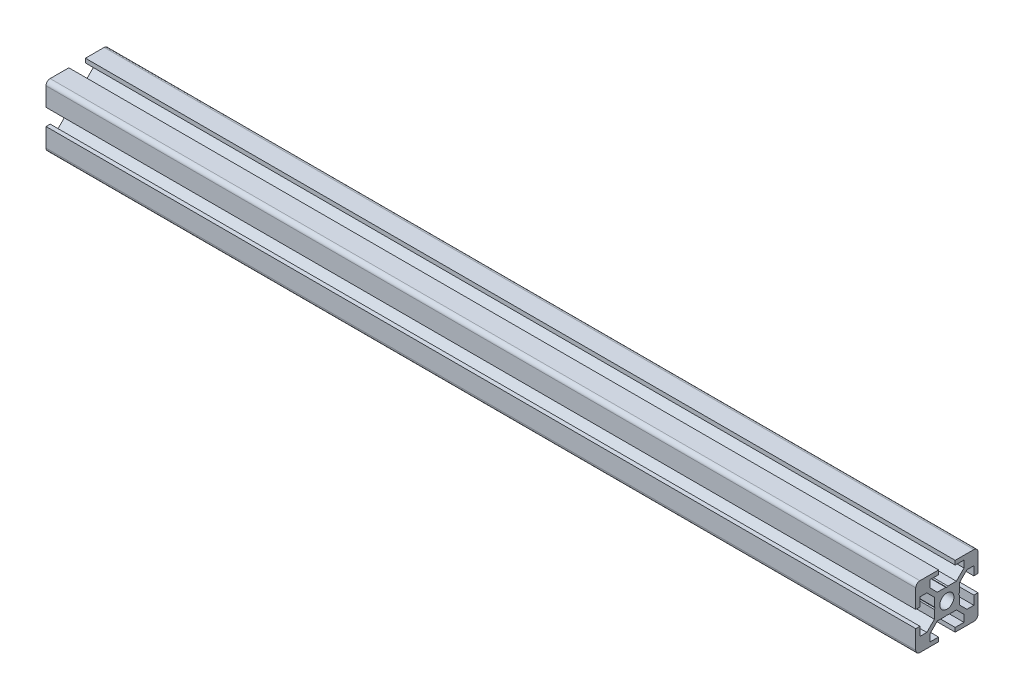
ISO-10303-21;
HEADER;
FILE_DESCRIPTION(('STEP AP214'),'2;1');
FILE_NAME('part.step','',(''),(''),'','','');
FILE_SCHEMA(('AUTOMOTIVE_DESIGN { 1 0 10303 214 1 1 1 1 }'));
ENDSEC;
DATA;
#1=APPLICATION_CONTEXT('core data for automotive mechanical design processes');
#2=APPLICATION_PROTOCOL_DEFINITION('international standard','automotive_design',2000,#1);
#3=PRODUCT_CONTEXT('',#1,'mechanical');
#4=PRODUCT('Part','Part','',(#3));
#5=PRODUCT_RELATED_PRODUCT_CATEGORY('part','',(#4));
#6=PRODUCT_DEFINITION_FORMATION('','',#4);
#7=PRODUCT_DEFINITION_CONTEXT('part definition',#1,'design');
#8=PRODUCT_DEFINITION('design','',#6,#7);
#9=PRODUCT_DEFINITION_SHAPE('','',#8);
#10=(LENGTH_UNIT() NAMED_UNIT(*) SI_UNIT(.MILLI.,.METRE.));
#11=(NAMED_UNIT(*) PLANE_ANGLE_UNIT() SI_UNIT($,.RADIAN.));
#12=(NAMED_UNIT(*) SI_UNIT($,.STERADIAN.) SOLID_ANGLE_UNIT());
#13=UNCERTAINTY_MEASURE_WITH_UNIT(LENGTH_MEASURE(1.E-05),#10,'distance_accuracy_value','');
#14=(GEOMETRIC_REPRESENTATION_CONTEXT(3) GLOBAL_UNCERTAINTY_ASSIGNED_CONTEXT((#13)) GLOBAL_UNIT_ASSIGNED_CONTEXT((#10,
#11,#12)) REPRESENTATION_CONTEXT('',''));
#15=CARTESIAN_POINT('',(0.,0.,0.));
#16=DIRECTION('',(0.,0.,1.));
#17=DIRECTION('',(1.,0.,0.));
#18=AXIS2_PLACEMENT_3D('',#15,#16,#17);
#19=CARTESIAN_POINT('',(209.55,-0.519626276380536,-5.99998915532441));
#20=DIRECTION('',(0.,-0.499999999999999,0.866025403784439));
#21=DIRECTION('',(0.,-0.866025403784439,-0.499999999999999));
#22=AXIS2_PLACEMENT_3D('',#19,#20,#21);
#23=PLANE('',#22);
#24=DIRECTION('',(-1.,0.,0.));
#25=VECTOR('',#24,1.);
#26=CARTESIAN_POINT('',(209.55,-1.10341098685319E-05,-5.69998915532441));
#27=LINE('',#26,#25);
#28=CARTESIAN_POINT('',(-3.17499999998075,-1.10341098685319E-05,-5.69998915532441));
#29=VERTEX_POINT('',#28);
#30=CARTESIAN_POINT('',(-209.55,-1.10341098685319E-05,-5.69998915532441));
#31=VERTEX_POINT('',#30);
#32=EDGE_CURVE('E617',#29,#31,#27,.T.);
#33=ORIENTED_EDGE('',*,*,#32,.F.);
#34=CARTESIAN_POINT('',(0.,0.,-5.69998278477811));
#35=DIRECTION('',(0.,-0.499999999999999,0.866025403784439));
#36=DIRECTION('',(0.,0.866025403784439,0.499999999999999));
#37=AXIS2_PLACEMENT_3D('',#34,#35,#36);
#38=ELLIPSE('',#37,3.66617420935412,3.175);
#39=CARTESIAN_POINT('',(-3.13218989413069,-0.519626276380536,-5.99998915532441));
#40=VERTEX_POINT('',#39);
#41=EDGE_CURVE('E763',#29,#40,#38,.T.);
#42=ORIENTED_EDGE('',*,*,#41,.T.);
#43=DIRECTION('',(-1.,0.,0.));
#44=VECTOR('',#43,1.);
#45=CARTESIAN_POINT('',(209.55,-0.519626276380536,-5.99998915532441));
#46=LINE('',#45,#44);
#47=CARTESIAN_POINT('',(-209.55,-0.519626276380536,-5.99998915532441));
#48=VERTEX_POINT('',#47);
#49=EDGE_CURVE('E622',#40,#48,#46,.T.);
#50=ORIENTED_EDGE('',*,*,#49,.T.);
#51=DIRECTION('',(0.,0.866025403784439,0.499999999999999));
#52=VECTOR('',#51,1.);
#53=CARTESIAN_POINT('',(-209.55,-0.519626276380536,-5.99998915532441));
#54=LINE('',#53,#52);
#55=EDGE_CURVE('E1020',#48,#31,#54,.T.);
#56=ORIENTED_EDGE('',*,*,#55,.T.);
#57=EDGE_LOOP('',(#33,#42,#50,#56));
#58=FACE_BOUND('',#57,.T.);
#59=ADVANCED_FACE('F45',(#58),#23,.F.);
#60=CARTESIAN_POINT('',(209.55,-1.10341098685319E-05,-5.69998915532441));
#61=DIRECTION('',(0.,0.499999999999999,0.866025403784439));
#62=DIRECTION('',(0.,-0.866025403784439,0.5));
#63=AXIS2_PLACEMENT_3D('',#60,#61,#62);
#64=PLANE('',#63);
#65=CARTESIAN_POINT('',(209.55,-1.10341098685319E-05,-5.69998915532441));
#66=VERTEX_POINT('',#65);
#67=CARTESIAN_POINT('',(3.17499999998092,-1.10341098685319E-05,-5.69998915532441));
#68=VERTEX_POINT('',#67);
#69=EDGE_CURVE('E618',#66,#68,#27,.T.);
#70=ORIENTED_EDGE('',*,*,#69,.T.);
#71=CARTESIAN_POINT('',(0.,0.,-5.69999552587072));
#72=DIRECTION('',(0.,0.499999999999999,0.866025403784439));
#73=DIRECTION('',(0.,-0.866025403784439,0.5));
#74=AXIS2_PLACEMENT_3D('',#71,#72,#73);
#75=ELLIPSE('',#74,3.66617420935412,3.175);
#76=CARTESIAN_POINT('',(3.13219355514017,0.519604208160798,-5.99998915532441));
#77=VERTEX_POINT('',#76);
#78=EDGE_CURVE('E1209',#68,#77,#75,.T.);
#79=ORIENTED_EDGE('',*,*,#78,.T.);
#80=DIRECTION('',(-1.,0.,0.));
#81=VECTOR('',#80,1.);
#82=CARTESIAN_POINT('',(209.55,0.519604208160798,-5.99998915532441));
#83=LINE('',#82,#81);
#84=CARTESIAN_POINT('',(209.55,0.519604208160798,-5.99998915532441));
#85=VERTEX_POINT('',#84);
#86=EDGE_CURVE('E613',#85,#77,#83,.T.);
#87=ORIENTED_EDGE('',*,*,#86,.F.);
#88=DIRECTION('',(0.,0.866025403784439,-0.5));
#89=VECTOR('',#88,1.);
#90=CARTESIAN_POINT('',(209.55,-1.10341098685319E-05,-5.69998915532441));
#91=LINE('',#90,#89);
#92=EDGE_CURVE('E843',#66,#85,#91,.T.);
#93=ORIENTED_EDGE('',*,*,#92,.F.);
#94=EDGE_LOOP('',(#70,#79,#87,#93));
#95=FACE_BOUND('',#94,.T.);
#96=ADVANCED_FACE('F723',(#95),#64,.F.);
#97=CARTESIAN_POINT('',(209.55,0.519604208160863,6.00001084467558));
#98=DIRECTION('',(0.,0.5,-0.866025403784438));
#99=DIRECTION('',(0.,0.866025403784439,0.5));
#100=AXIS2_PLACEMENT_3D('',#97,#98,#99);
#101=PLANE('',#100);
#102=DIRECTION('',(-1.,0.,0.));
#103=VECTOR('',#102,1.);
#104=CARTESIAN_POINT('',(209.55,0.519604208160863,6.00001084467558));
#105=LINE('',#104,#103);
#106=CARTESIAN_POINT('',(209.55,0.519604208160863,6.00001084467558));
#107=VERTEX_POINT('',#106);
#108=CARTESIAN_POINT('',(3.13219355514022,0.519604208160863,6.00001084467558));
#109=VERTEX_POINT('',#108);
#110=EDGE_CURVE('E500',#107,#109,#105,.T.);
#111=ORIENTED_EDGE('',*,*,#110,.T.);
#112=CARTESIAN_POINT('',(0.,0.,5.70001721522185));
#113=DIRECTION('',(0.,0.5,-0.866025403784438));
#114=DIRECTION('',(0.,0.866025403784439,0.5));
#115=AXIS2_PLACEMENT_3D('',#112,#113,#114);
#116=ELLIPSE('',#115,3.66617420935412,3.175);
#117=CARTESIAN_POINT('',(3.17499999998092,-1.10341097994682E-05,5.70001084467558));
#118=VERTEX_POINT('',#117);
#119=EDGE_CURVE('E1195',#109,#118,#116,.T.);
#120=ORIENTED_EDGE('',*,*,#119,.T.);
#121=DIRECTION('',(-1.,0.,0.));
#122=VECTOR('',#121,1.);
#123=CARTESIAN_POINT('',(209.55,-1.10341097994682E-05,5.70001084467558));
#124=LINE('',#123,#122);
#125=CARTESIAN_POINT('',(209.55,-1.10341097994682E-05,5.70001084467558));
#126=VERTEX_POINT('',#125);
#127=EDGE_CURVE('E481',#126,#118,#124,.T.);
#128=ORIENTED_EDGE('',*,*,#127,.F.);
#129=DIRECTION('',(0.,-0.866025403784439,-0.5));
#130=VECTOR('',#129,1.);
#131=CARTESIAN_POINT('',(209.55,0.519604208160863,6.00001084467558));
#132=LINE('',#131,#130);
#133=EDGE_CURVE('E930',#107,#126,#132,.T.);
#134=ORIENTED_EDGE('',*,*,#133,.F.);
#135=EDGE_LOOP('',(#111,#120,#128,#134));
#136=FACE_BOUND('',#135,.T.);
#137=ADVANCED_FACE('F731',(#136),#101,.F.);
#138=CARTESIAN_POINT('',(209.55,-1.10341097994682E-05,5.70001084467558));
#139=DIRECTION('',(0.,-0.5,-0.866025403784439));
#140=DIRECTION('',(0.,0.866025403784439,-0.5));
#141=AXIS2_PLACEMENT_3D('',#138,#139,#140);
#142=PLANE('',#141);
#143=DIRECTION('',(-1.,0.,0.));
#144=VECTOR('',#143,1.);
#145=CARTESIAN_POINT('',(209.55,-0.519626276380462,6.00001084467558));
#146=LINE('',#145,#144);
#147=CARTESIAN_POINT('',(-3.13218989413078,-0.519626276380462,6.00001084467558));
#148=VERTEX_POINT('',#147);
#149=CARTESIAN_POINT('',(-209.55,-0.519626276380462,6.00001084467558));
#150=VERTEX_POINT('',#149);
#151=EDGE_CURVE('E489',#148,#150,#146,.T.);
#152=ORIENTED_EDGE('',*,*,#151,.F.);
#153=CARTESIAN_POINT('',(0.,0.,5.70000447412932));
#154=DIRECTION('',(0.,-0.5,-0.866025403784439));
#155=DIRECTION('',(0.,-0.866025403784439,0.5));
#156=AXIS2_PLACEMENT_3D('',#153,#154,#155);
#157=ELLIPSE('',#156,3.66617420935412,3.175);
#158=CARTESIAN_POINT('',(-3.17499999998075,-1.10341097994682E-05,5.70001084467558));
#159=VERTEX_POINT('',#158);
#160=EDGE_CURVE('E76',#148,#159,#157,.T.);
#161=ORIENTED_EDGE('',*,*,#160,.T.);
#162=CARTESIAN_POINT('',(-209.55,-1.10341097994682E-05,5.70001084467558));
#163=VERTEX_POINT('',#162);
#164=EDGE_CURVE('E488',#159,#163,#124,.T.);
#165=ORIENTED_EDGE('',*,*,#164,.T.);
#166=DIRECTION('',(0.,-0.866025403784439,0.5));
#167=VECTOR('',#166,1.);
#168=CARTESIAN_POINT('',(-209.55,-1.10341097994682E-05,5.70001084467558));
#169=LINE('',#168,#167);
#170=EDGE_CURVE('E1117',#163,#150,#169,.T.);
#171=ORIENTED_EDGE('',*,*,#170,.T.);
#172=EDGE_LOOP('',(#152,#161,#165,#171));
#173=FACE_BOUND('',#172,.T.);
#174=ADVANCED_FACE('F1247',(#173),#142,.F.);
#175=CARTESIAN_POINT('',(209.55,-13.0000110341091,-12.9999891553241));
#176=DIRECTION('',(1.,0.,0.));
#177=DIRECTION('',(0.,0.,-1.));
#178=AXIS2_PLACEMENT_3D('',#175,#176,#177);
#179=PLANE('',#178);
#180=DIRECTION('',(0.,0.,-1.));
#181=VECTOR('',#180,1.);
#182=CARTESIAN_POINT('',(209.55,-15.0000110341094,13.0000108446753));
#183=LINE('',#182,#181);
#184=CARTESIAN_POINT('',(209.55,-15.0000110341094,13.0000108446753));
#185=VERTEX_POINT('',#184);
#186=CARTESIAN_POINT('',(209.55,-15.0000110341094,4.00001084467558));
#187=VERTEX_POINT('',#186);
#188=EDGE_CURVE('E777',#185,#187,#183,.T.);
#189=ORIENTED_EDGE('',*,*,#188,.T.);
#190=DIRECTION('',(0.,1.,0.));
#191=VECTOR('',#190,1.);
#192=CARTESIAN_POINT('',(209.55,-15.0000110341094,4.00001084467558));
#193=LINE('',#192,#191);
#194=CARTESIAN_POINT('',(209.55,-13.0000110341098,4.00001084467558));
#195=VERTEX_POINT('',#194);
#196=EDGE_CURVE('E781',#187,#195,#193,.T.);
#197=ORIENTED_EDGE('',*,*,#196,.T.);
#198=DIRECTION('',(0.,0.,1.));
#199=VECTOR('',#198,1.);
#200=CARTESIAN_POINT('',(209.55,-13.0000110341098,4.00001084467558));
#201=LINE('',#200,#199);
#202=CARTESIAN_POINT('',(209.55,-13.0000110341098,8.25001084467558));
#203=VERTEX_POINT('',#202);
#204=EDGE_CURVE('E785',#195,#203,#201,.T.);
#205=ORIENTED_EDGE('',*,*,#204,.T.);
#206=DIRECTION('',(0.,1.,0.));
#207=VECTOR('',#206,1.);
#208=CARTESIAN_POINT('',(209.55,-13.0000110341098,8.25001084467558));
#209=LINE('',#208,#207);
#210=CARTESIAN_POINT('',(209.55,-9.66422459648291,8.25001084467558));
#211=VERTEX_POINT('',#210);
#212=EDGE_CURVE('E788',#203,#211,#209,.T.);
#213=ORIENTED_EDGE('',*,*,#212,.T.);
#214=DIRECTION('',(0.,0.707106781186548,-0.707106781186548));
#215=VECTOR('',#214,1.);
#216=CARTESIAN_POINT('',(209.55,-9.66422459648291,8.25001084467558));
#217=LINE('',#216,#215);
#218=CARTESIAN_POINT('',(209.55,-6.0000110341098,4.58579728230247));
#219=VERTEX_POINT('',#218);
#220=EDGE_CURVE('E791',#211,#219,#217,.T.);
#221=ORIENTED_EDGE('',*,*,#220,.T.);
#222=DIRECTION('',(0.,0.,-1.));
#223=VECTOR('',#222,1.);
#224=CARTESIAN_POINT('',(209.55,-6.0000110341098,4.58579728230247));
#225=LINE('',#224,#223);
#226=CARTESIAN_POINT('',(209.55,-6.0000110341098,0.519626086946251));
#227=VERTEX_POINT('',#226);
#228=EDGE_CURVE('E794',#219,#227,#225,.T.);
#229=ORIENTED_EDGE('',*,*,#228,.T.);
#230=DIRECTION('',(0.,0.5,-0.866025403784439));
#231=VECTOR('',#230,1.);
#232=CARTESIAN_POINT('',(209.55,-6.0000110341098,0.519626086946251));
#233=LINE('',#232,#231);
#234=CARTESIAN_POINT('',(209.55,-5.7000110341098,1.08446755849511E-05));
#235=VERTEX_POINT('',#234);
#236=EDGE_CURVE('E797',#227,#235,#233,.T.);
#237=ORIENTED_EDGE('',*,*,#236,.T.);
#238=DIRECTION('',(0.,-0.5,-0.866025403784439));
#239=VECTOR('',#238,1.);
#240=CARTESIAN_POINT('',(209.55,-5.7000110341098,1.08446755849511E-05));
#241=LINE('',#240,#239);
#242=CARTESIAN_POINT('',(209.55,-6.0000110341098,-0.519604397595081));
#243=VERTEX_POINT('',#242);
#244=EDGE_CURVE('E800',#235,#243,#241,.T.);
#245=ORIENTED_EDGE('',*,*,#244,.T.);
#246=DIRECTION('',(0.,0.,-1.));
#247=VECTOR('',#246,1.);
#248=CARTESIAN_POINT('',(209.55,-6.0000110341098,-0.519604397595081));
#249=LINE('',#248,#247);
#250=CARTESIAN_POINT('',(209.55,-6.0000110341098,-4.58577559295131));
#251=VERTEX_POINT('',#250);
#252=EDGE_CURVE('E803',#243,#251,#249,.T.);
#253=ORIENTED_EDGE('',*,*,#252,.T.);
#254=DIRECTION('',(0.,-0.707106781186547,-0.707106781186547));
#255=VECTOR('',#254,1.);
#256=CARTESIAN_POINT('',(209.55,-6.0000110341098,-4.58577559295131));
#257=LINE('',#256,#255);
#258=CARTESIAN_POINT('',(209.55,-9.66422459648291,-8.24998915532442));
#259=VERTEX_POINT('',#258);
#260=EDGE_CURVE('E806',#251,#259,#257,.T.);
#261=ORIENTED_EDGE('',*,*,#260,.T.);
#262=DIRECTION('',(0.,-1.,0.));
#263=VECTOR('',#262,1.);
#264=CARTESIAN_POINT('',(209.55,-9.66422459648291,-8.24998915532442));
#265=LINE('',#264,#263);
#266=CARTESIAN_POINT('',(209.55,-13.0000110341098,-8.24998915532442));
#267=VERTEX_POINT('',#266);
#268=EDGE_CURVE('E809',#259,#267,#265,.T.);
#269=ORIENTED_EDGE('',*,*,#268,.T.);
#270=DIRECTION('',(0.,0.,1.));
#271=VECTOR('',#270,1.);
#272=CARTESIAN_POINT('',(209.55,-13.0000110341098,-8.24998915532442));
#273=LINE('',#272,#271);
#274=CARTESIAN_POINT('',(209.55,-13.0000110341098,-3.99998915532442));
#275=VERTEX_POINT('',#274);
#276=EDGE_CURVE('E812',#267,#275,#273,.T.);
#277=ORIENTED_EDGE('',*,*,#276,.T.);
#278=DIRECTION('',(0.,-1.,0.));
#279=VECTOR('',#278,1.);
#280=CARTESIAN_POINT('',(209.55,-13.0000110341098,-3.99998915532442));
#281=LINE('',#280,#279);
#282=CARTESIAN_POINT('',(209.55,-15.0000110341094,-3.99998915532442));
#283=VERTEX_POINT('',#282);
#284=EDGE_CURVE('E815',#275,#283,#281,.T.);
#285=ORIENTED_EDGE('',*,*,#284,.T.);
#286=DIRECTION('',(0.,0.,-1.));
#287=VECTOR('',#286,1.);
#288=CARTESIAN_POINT('',(209.55,-15.0000110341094,-3.99998915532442));
#289=LINE('',#288,#287);
#290=CARTESIAN_POINT('',(209.55,-15.0000110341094,-12.9999891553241));
#291=VERTEX_POINT('',#290);
#292=EDGE_CURVE('E818',#283,#291,#289,.T.);
#293=ORIENTED_EDGE('',*,*,#292,.T.);
#294=CARTESIAN_POINT('',(209.55,-13.0000110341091,-12.9999891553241));
#295=DIRECTION('',(1.,0.,0.));
#296=DIRECTION('',(0.,0.,-1.));
#297=AXIS2_PLACEMENT_3D('',#294,#295,#296);
#298=CIRCLE('',#297,2.00000000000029);
#299=CARTESIAN_POINT('',(209.55,-13.0000110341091,-14.9999891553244));
#300=VERTEX_POINT('',#299);
#301=EDGE_CURVE('E821',#291,#300,#298,.T.);
#302=ORIENTED_EDGE('',*,*,#301,.T.);
#303=DIRECTION('',(0.,1.,0.));
#304=VECTOR('',#303,1.);
#305=CARTESIAN_POINT('',(209.55,-13.0000110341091,-14.9999891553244));
#306=LINE('',#305,#304);
#307=CARTESIAN_POINT('',(209.55,-4.00001103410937,-14.9999891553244));
#308=VERTEX_POINT('',#307);
#309=EDGE_CURVE('E824',#300,#308,#306,.T.);
#310=ORIENTED_EDGE('',*,*,#309,.T.);
#311=DIRECTION('',(0.,0.,1.));
#312=VECTOR('',#311,1.);
#313=CARTESIAN_POINT('',(209.55,-4.00001103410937,-14.9999891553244));
#314=LINE('',#313,#312);
#315=CARTESIAN_POINT('',(209.55,-4.00001103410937,-12.9999891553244));
#316=VERTEX_POINT('',#315);
#317=EDGE_CURVE('E827',#308,#316,#314,.T.);
#318=ORIENTED_EDGE('',*,*,#317,.T.);
#319=DIRECTION('',(0.,-1.,0.));
#320=VECTOR('',#319,1.);
#321=CARTESIAN_POINT('',(209.55,-4.00001103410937,-12.9999891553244));
#322=LINE('',#321,#320);
#323=CARTESIAN_POINT('',(209.55,-8.25001103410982,-12.9999891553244));
#324=VERTEX_POINT('',#323);
#325=EDGE_CURVE('E830',#316,#324,#322,.T.);
#326=ORIENTED_EDGE('',*,*,#325,.T.);
#327=DIRECTION('',(0.,0.,1.));
#328=VECTOR('',#327,1.);
#329=CARTESIAN_POINT('',(209.55,-8.25001103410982,-12.9999891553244));
#330=LINE('',#329,#328);
#331=CARTESIAN_POINT('',(209.55,-8.25001103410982,-9.66420271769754));
#332=VERTEX_POINT('',#331);
#333=EDGE_CURVE('E833',#324,#332,#330,.T.);
#334=ORIENTED_EDGE('',*,*,#333,.T.);
#335=DIRECTION('',(0.,0.707106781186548,0.707106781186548));
#336=VECTOR('',#335,1.);
#337=CARTESIAN_POINT('',(209.55,-8.25001103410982,-9.66420271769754));
#338=LINE('',#337,#336);
#339=CARTESIAN_POINT('',(209.55,-4.58579747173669,-5.99998915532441));
#340=VERTEX_POINT('',#339);
#341=EDGE_CURVE('E836',#332,#340,#338,.T.);
#342=ORIENTED_EDGE('',*,*,#341,.T.);
#343=DIRECTION('',(0.,1.,0.));
#344=VECTOR('',#343,1.);
#345=CARTESIAN_POINT('',(209.55,-4.58579747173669,-5.99998915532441));
#346=LINE('',#345,#344);
#347=CARTESIAN_POINT('',(209.55,-0.519626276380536,-5.99998915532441));
#348=VERTEX_POINT('',#347);
#349=EDGE_CURVE('E757',#340,#348,#346,.T.);
#350=ORIENTED_EDGE('',*,*,#349,.T.);
#351=DIRECTION('',(0.,0.866025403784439,0.499999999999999));
#352=VECTOR('',#351,1.);
#353=CARTESIAN_POINT('',(209.55,-0.519626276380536,-5.99998915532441));
#354=LINE('',#353,#352);
#355=EDGE_CURVE('E753',#348,#66,#354,.T.);
#356=ORIENTED_EDGE('',*,*,#355,.T.);
#357=ORIENTED_EDGE('',*,*,#92,.T.);
#358=DIRECTION('',(0.,1.,0.));
#359=VECTOR('',#358,1.);
#360=CARTESIAN_POINT('',(209.55,0.519604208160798,-5.99998915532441));
#361=LINE('',#360,#359);
#362=CARTESIAN_POINT('',(209.55,4.58577540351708,-5.99998915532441));
#363=VERTEX_POINT('',#362);
#364=EDGE_CURVE('E846',#85,#363,#361,.T.);
#365=ORIENTED_EDGE('',*,*,#364,.T.);
#366=DIRECTION('',(0.,0.707106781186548,-0.707106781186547));
#367=VECTOR('',#366,1.);
#368=CARTESIAN_POINT('',(209.55,4.58577540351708,-5.99998915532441));
#369=LINE('',#368,#367);
#370=CARTESIAN_POINT('',(209.55,8.24998896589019,-9.66420271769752));
#371=VERTEX_POINT('',#370);
#372=EDGE_CURVE('E849',#363,#371,#369,.T.);
#373=ORIENTED_EDGE('',*,*,#372,.T.);
#374=DIRECTION('',(0.,0.,-1.));
#375=VECTOR('',#374,1.);
#376=CARTESIAN_POINT('',(209.55,8.24998896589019,-9.66420271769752));
#377=LINE('',#376,#375);
#378=CARTESIAN_POINT('',(209.55,8.24998896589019,-12.9999891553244));
#379=VERTEX_POINT('',#378);
#380=EDGE_CURVE('E852',#371,#379,#377,.T.);
#381=ORIENTED_EDGE('',*,*,#380,.T.);
#382=DIRECTION('',(0.,-1.,0.));
#383=VECTOR('',#382,1.);
#384=CARTESIAN_POINT('',(209.55,8.24998896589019,-12.9999891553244));
#385=LINE('',#384,#383);
#386=CARTESIAN_POINT('',(209.55,3.99998896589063,-12.9999891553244));
#387=VERTEX_POINT('',#386);
#388=EDGE_CURVE('E855',#379,#387,#385,.T.);
#389=ORIENTED_EDGE('',*,*,#388,.T.);
#390=DIRECTION('',(0.,0.,-1.));
#391=VECTOR('',#390,1.);
#392=CARTESIAN_POINT('',(209.55,3.99998896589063,-12.9999891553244));
#393=LINE('',#392,#391);
#394=CARTESIAN_POINT('',(209.55,3.99998896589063,-14.9999891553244));
#395=VERTEX_POINT('',#394);
#396=EDGE_CURVE('E858',#387,#395,#393,.T.);
#397=ORIENTED_EDGE('',*,*,#396,.T.);
#398=DIRECTION('',(0.,1.,0.));
#399=VECTOR('',#398,1.);
#400=CARTESIAN_POINT('',(209.55,3.99998896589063,-14.9999891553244));
#401=LINE('',#400,#399);
#402=CARTESIAN_POINT('',(209.55,12.9999889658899,-14.9999891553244));
#403=VERTEX_POINT('',#402);
#404=EDGE_CURVE('E861',#395,#403,#401,.T.);
#405=ORIENTED_EDGE('',*,*,#404,.T.);
#406=CARTESIAN_POINT('',(209.55,12.9999889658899,-12.9999891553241));
#407=DIRECTION('',(1.,0.,0.));
#408=DIRECTION('',(0.,0.,-1.));
#409=AXIS2_PLACEMENT_3D('',#406,#407,#408);
#410=CIRCLE('',#409,2.00000000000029);
#411=CARTESIAN_POINT('',(209.55,14.9999889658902,-12.9999891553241));
#412=VERTEX_POINT('',#411);
#413=EDGE_CURVE('E864',#403,#412,#410,.T.);
#414=ORIENTED_EDGE('',*,*,#413,.T.);
#415=DIRECTION('',(0.,0.,1.));
#416=VECTOR('',#415,1.);
#417=CARTESIAN_POINT('',(209.55,14.9999889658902,-12.9999891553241));
#418=LINE('',#417,#416);
#419=CARTESIAN_POINT('',(209.55,14.9999889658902,-3.99998915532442));
#420=VERTEX_POINT('',#419);
#421=EDGE_CURVE('E867',#412,#420,#418,.T.);
#422=ORIENTED_EDGE('',*,*,#421,.T.);
#423=DIRECTION('',(0.,-1.,0.));
#424=VECTOR('',#423,1.);
#425=CARTESIAN_POINT('',(209.55,14.9999889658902,-3.99998915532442));
#426=LINE('',#425,#424);
#427=CARTESIAN_POINT('',(209.55,12.9999889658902,-3.99998915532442));
#428=VERTEX_POINT('',#427);
#429=EDGE_CURVE('E870',#420,#428,#426,.T.);
#430=ORIENTED_EDGE('',*,*,#429,.T.);
#431=DIRECTION('',(0.,0.,-1.));
#432=VECTOR('',#431,1.);
#433=CARTESIAN_POINT('',(209.55,12.9999889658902,-3.99998915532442));
#434=LINE('',#433,#432);
#435=CARTESIAN_POINT('',(209.55,12.9999889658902,-8.24998915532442));
#436=VERTEX_POINT('',#435);
#437=EDGE_CURVE('E873',#428,#436,#434,.T.);
#438=ORIENTED_EDGE('',*,*,#437,.T.);
#439=DIRECTION('',(0.,-1.,0.));
#440=VECTOR('',#439,1.);
#441=CARTESIAN_POINT('',(209.55,12.9999889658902,-8.24998915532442));
#442=LINE('',#441,#440);
#443=CARTESIAN_POINT('',(209.55,9.66420252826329,-8.24998915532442));
#444=VERTEX_POINT('',#443);
#445=EDGE_CURVE('E876',#436,#444,#442,.T.);
#446=ORIENTED_EDGE('',*,*,#445,.T.);
#447=DIRECTION('',(0.,-0.707106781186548,0.707106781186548));
#448=VECTOR('',#447,1.);
#449=CARTESIAN_POINT('',(209.55,9.66420252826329,-8.24998915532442));
#450=LINE('',#449,#448);
#451=CARTESIAN_POINT('',(209.55,5.9999889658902,-4.58577559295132));
#452=VERTEX_POINT('',#451);
#453=EDGE_CURVE('E879',#444,#452,#450,.T.);
#454=ORIENTED_EDGE('',*,*,#453,.T.);
#455=DIRECTION('',(0.,0.,1.));
#456=VECTOR('',#455,1.);
#457=CARTESIAN_POINT('',(209.55,5.9999889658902,-4.58577559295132));
#458=LINE('',#457,#456);
#459=CARTESIAN_POINT('',(209.55,5.9999889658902,-0.519604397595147));
#460=VERTEX_POINT('',#459);
#461=EDGE_CURVE('E882',#452,#460,#458,.T.);
#462=ORIENTED_EDGE('',*,*,#461,.T.);
#463=DIRECTION('',(0.,-0.499999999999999,0.866025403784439));
#464=VECTOR('',#463,1.);
#465=CARTESIAN_POINT('',(209.55,5.9999889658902,-0.519604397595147));
#466=LINE('',#465,#464);
#467=CARTESIAN_POINT('',(209.55,5.69998896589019,1.08446755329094E-05));
#468=VERTEX_POINT('',#467);
#469=EDGE_CURVE('E885',#460,#468,#466,.T.);
#470=ORIENTED_EDGE('',*,*,#469,.T.);
#471=DIRECTION('',(0.,0.5,0.866025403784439));
#472=VECTOR('',#471,1.);
#473=CARTESIAN_POINT('',(209.55,5.69998896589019,1.08446755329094E-05));
#474=LINE('',#473,#472);
#475=CARTESIAN_POINT('',(209.55,5.9999889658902,0.519626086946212));
#476=VERTEX_POINT('',#475);
#477=EDGE_CURVE('E888',#468,#476,#474,.T.);
#478=ORIENTED_EDGE('',*,*,#477,.T.);
#479=DIRECTION('',(0.,0.,1.));
#480=VECTOR('',#479,1.);
#481=CARTESIAN_POINT('',(209.55,5.9999889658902,0.519626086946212));
#482=LINE('',#481,#480);
#483=CARTESIAN_POINT('',(209.55,5.9999889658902,4.58579728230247));
#484=VERTEX_POINT('',#483);
#485=EDGE_CURVE('E891',#476,#484,#482,.T.);
#486=ORIENTED_EDGE('',*,*,#485,.T.);
#487=DIRECTION('',(0.,0.707106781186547,0.707106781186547));
#488=VECTOR('',#487,1.);
#489=CARTESIAN_POINT('',(209.55,5.9999889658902,4.58579728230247));
#490=LINE('',#489,#488);
#491=CARTESIAN_POINT('',(209.55,9.66420252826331,8.25001084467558));
#492=VERTEX_POINT('',#491);
#493=EDGE_CURVE('E894',#484,#492,#490,.T.);
#494=ORIENTED_EDGE('',*,*,#493,.T.);
#495=DIRECTION('',(0.,1.,0.));
#496=VECTOR('',#495,1.);
#497=CARTESIAN_POINT('',(209.55,9.66420252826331,8.25001084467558));
#498=LINE('',#497,#496);
#499=CARTESIAN_POINT('',(209.55,12.9999889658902,8.25001084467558));
#500=VERTEX_POINT('',#499);
#501=EDGE_CURVE('E897',#492,#500,#498,.T.);
#502=ORIENTED_EDGE('',*,*,#501,.T.);
#503=DIRECTION('',(0.,0.,-1.));
#504=VECTOR('',#503,1.);
#505=CARTESIAN_POINT('',(209.55,12.9999889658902,8.25001084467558));
#506=LINE('',#505,#504);
#507=CARTESIAN_POINT('',(209.55,12.9999889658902,4.00001084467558));
#508=VERTEX_POINT('',#507);
#509=EDGE_CURVE('E900',#500,#508,#506,.T.);
#510=ORIENTED_EDGE('',*,*,#509,.T.);
#511=DIRECTION('',(0.,1.,0.));
#512=VECTOR('',#511,1.);
#513=CARTESIAN_POINT('',(209.55,12.9999889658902,4.00001084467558));
#514=LINE('',#513,#512);
#515=CARTESIAN_POINT('',(209.55,14.9999889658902,4.00001084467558));
#516=VERTEX_POINT('',#515);
#517=EDGE_CURVE('E903',#508,#516,#514,.T.);
#518=ORIENTED_EDGE('',*,*,#517,.T.);
#519=DIRECTION('',(0.,0.,1.));
#520=VECTOR('',#519,1.);
#521=CARTESIAN_POINT('',(209.55,14.9999889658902,4.00001084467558));
#522=LINE('',#521,#520);
#523=CARTESIAN_POINT('',(209.55,14.9999889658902,13.0000108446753));
#524=VERTEX_POINT('',#523);
#525=EDGE_CURVE('E906',#516,#524,#522,.T.);
#526=ORIENTED_EDGE('',*,*,#525,.T.);
#527=CARTESIAN_POINT('',(209.55,12.99998896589,13.0000108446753));
#528=DIRECTION('',(1.,0.,0.));
#529=DIRECTION('',(0.,0.,-1.));
#530=AXIS2_PLACEMENT_3D('',#527,#528,#529);
#531=CIRCLE('',#530,2.00000000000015);
#532=CARTESIAN_POINT('',(209.55,12.99998896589,15.0000108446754));
#533=VERTEX_POINT('',#532);
#534=EDGE_CURVE('E909',#524,#533,#531,.T.);
#535=ORIENTED_EDGE('',*,*,#534,.T.);
#536=DIRECTION('',(0.,-1.,0.));
#537=VECTOR('',#536,1.);
#538=CARTESIAN_POINT('',(209.55,12.99998896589,15.0000108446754));
#539=LINE('',#538,#537);
#540=CARTESIAN_POINT('',(209.55,3.99998896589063,15.0000108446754));
#541=VERTEX_POINT('',#540);
#542=EDGE_CURVE('E912',#533,#541,#539,.T.);
#543=ORIENTED_EDGE('',*,*,#542,.T.);
#544=DIRECTION('',(0.,0.,-1.));
#545=VECTOR('',#544,1.);
#546=CARTESIAN_POINT('',(209.55,3.99998896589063,15.0000108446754));
#547=LINE('',#546,#545);
#548=CARTESIAN_POINT('',(209.55,3.99998896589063,13.0000108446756));
#549=VERTEX_POINT('',#548);
#550=EDGE_CURVE('E915',#541,#549,#547,.T.);
#551=ORIENTED_EDGE('',*,*,#550,.T.);
#552=DIRECTION('',(0.,1.,0.));
#553=VECTOR('',#552,1.);
#554=CARTESIAN_POINT('',(209.55,3.99998896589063,13.0000108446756));
#555=LINE('',#554,#553);
#556=CARTESIAN_POINT('',(209.55,8.24998896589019,13.0000108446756));
#557=VERTEX_POINT('',#556);
#558=EDGE_CURVE('E918',#549,#557,#555,.T.);
#559=ORIENTED_EDGE('',*,*,#558,.T.);
#560=DIRECTION('',(0.,0.,-1.));
#561=VECTOR('',#560,1.);
#562=CARTESIAN_POINT('',(209.55,8.24998896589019,13.0000108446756));
#563=LINE('',#562,#561);
#564=CARTESIAN_POINT('',(209.55,8.24998896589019,9.66422440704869));
#565=VERTEX_POINT('',#564);
#566=EDGE_CURVE('E921',#557,#565,#563,.T.);
#567=ORIENTED_EDGE('',*,*,#566,.T.);
#568=DIRECTION('',(0.,-0.707106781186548,-0.707106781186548));
#569=VECTOR('',#568,1.);
#570=CARTESIAN_POINT('',(209.55,8.24998896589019,9.66422440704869));
#571=LINE('',#570,#569);
#572=CARTESIAN_POINT('',(209.55,4.58577540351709,6.00001084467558));
#573=VERTEX_POINT('',#572);
#574=EDGE_CURVE('E924',#565,#573,#571,.T.);
#575=ORIENTED_EDGE('',*,*,#574,.T.);
#576=DIRECTION('',(0.,-1.,0.));
#577=VECTOR('',#576,1.);
#578=CARTESIAN_POINT('',(209.55,4.58577540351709,6.00001084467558));
#579=LINE('',#578,#577);
#580=EDGE_CURVE('E927',#573,#107,#579,.T.);
#581=ORIENTED_EDGE('',*,*,#580,.T.);
#582=ORIENTED_EDGE('',*,*,#133,.T.);
#583=DIRECTION('',(0.,-0.866025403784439,0.5));
#584=VECTOR('',#583,1.);
#585=CARTESIAN_POINT('',(209.55,-1.10341097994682E-05,5.70001084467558));
#586=LINE('',#585,#584);
#587=CARTESIAN_POINT('',(209.55,-0.519626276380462,6.00001084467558));
#588=VERTEX_POINT('',#587);
#589=EDGE_CURVE('E933',#126,#588,#586,.T.);
#590=ORIENTED_EDGE('',*,*,#589,.T.);
#591=DIRECTION('',(0.,-1.,0.));
#592=VECTOR('',#591,1.);
#593=CARTESIAN_POINT('',(209.55,-0.519626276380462,6.00001084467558));
#594=LINE('',#593,#592);
#595=CARTESIAN_POINT('',(209.55,-4.58579747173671,6.00001084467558));
#596=VERTEX_POINT('',#595);
#597=EDGE_CURVE('E486',#588,#596,#594,.T.);
#598=ORIENTED_EDGE('',*,*,#597,.T.);
#599=DIRECTION('',(0.,-0.707106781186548,0.707106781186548));
#600=VECTOR('',#599,1.);
#601=CARTESIAN_POINT('',(209.55,-4.58579747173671,6.00001084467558));
#602=LINE('',#601,#600);
#603=CARTESIAN_POINT('',(209.55,-8.25001103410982,9.66422440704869));
#604=VERTEX_POINT('',#603);
#605=EDGE_CURVE('E938',#596,#604,#602,.T.);
#606=ORIENTED_EDGE('',*,*,#605,.T.);
#607=DIRECTION('',(0.,0.,1.));
#608=VECTOR('',#607,1.);
#609=CARTESIAN_POINT('',(209.55,-8.25001103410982,9.66422440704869));
#610=LINE('',#609,#608);
#611=CARTESIAN_POINT('',(209.55,-8.25001103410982,13.0000108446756));
#612=VERTEX_POINT('',#611);
#613=EDGE_CURVE('E941',#604,#612,#610,.T.);
#614=ORIENTED_EDGE('',*,*,#613,.T.);
#615=DIRECTION('',(0.,1.,0.));
#616=VECTOR('',#615,1.);
#617=CARTESIAN_POINT('',(209.55,-8.25001103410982,13.0000108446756));
#618=LINE('',#617,#616);
#619=CARTESIAN_POINT('',(209.55,-4.00001103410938,13.0000108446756));
#620=VERTEX_POINT('',#619);
#621=EDGE_CURVE('E944',#612,#620,#618,.T.);
#622=ORIENTED_EDGE('',*,*,#621,.T.);
#623=DIRECTION('',(0.,0.,1.));
#624=VECTOR('',#623,1.);
#625=CARTESIAN_POINT('',(209.55,-4.00001103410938,13.0000108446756));
#626=LINE('',#625,#624);
#627=CARTESIAN_POINT('',(209.55,-4.00001103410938,15.0000108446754));
#628=VERTEX_POINT('',#627);
#629=EDGE_CURVE('E947',#620,#628,#626,.T.);
#630=ORIENTED_EDGE('',*,*,#629,.T.);
#631=DIRECTION('',(0.,-1.,0.));
#632=VECTOR('',#631,1.);
#633=CARTESIAN_POINT('',(209.55,-4.00001103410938,15.0000108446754));
#634=LINE('',#633,#632);
#635=CARTESIAN_POINT('',(209.55,-13.0000110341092,15.0000108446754));
#636=VERTEX_POINT('',#635);
#637=EDGE_CURVE('E950',#628,#636,#634,.T.);
#638=ORIENTED_EDGE('',*,*,#637,.T.);
#639=CARTESIAN_POINT('',(209.55,-13.0000110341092,13.0000108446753));
#640=DIRECTION('',(1.,0.,0.));
#641=DIRECTION('',(0.,0.,-1.));
#642=AXIS2_PLACEMENT_3D('',#639,#640,#641);
#643=CIRCLE('',#642,2.00000000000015);
#644=EDGE_CURVE('E953',#636,#185,#643,.T.);
#645=ORIENTED_EDGE('',*,*,#644,.T.);
#646=EDGE_LOOP('',(#189,#197,#205,#213,#221,#229,#237,#245,#253,#261,#269,#277,#285,#293,#302,
#310,#318,#326,#334,#342,#350,#356,#357,#365,#373,#381,#389,#397,#405,#414,#422,#430,#438,#446,
#454,#462,#470,#478,#486,#494,#502,#510,#518,#526,#535,#543,#551,#559,#567,#575,#581,#582,#590,
#598,#606,#614,#622,#630,#638,#645));
#647=FACE_BOUND('',#646,.T.);
#648=CARTESIAN_POINT('',(209.55,-1.10341099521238E-05,1.08446754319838E-05));
#649=DIRECTION('',(1.,0.,0.));
#650=DIRECTION('',(0.,0.,1.));
#651=AXIS2_PLACEMENT_3D('',#648,#649,#650);
#652=CIRCLE('',#651,3.39999999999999);
#653=CARTESIAN_POINT('',(209.55,-1.10341099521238E-05,3.40001084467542));
#654=VERTEX_POINT('',#653);
#655=EDGE_CURVE('E768',#654,#654,#652,.T.);
#656=ORIENTED_EDGE('',*,*,#655,.F.);
#657=EDGE_LOOP('',(#656));
#658=FACE_BOUND('',#657,.T.);
#659=ADVANCED_FACE('F1188',(#647,#658),#179,.T.);
#660=CARTESIAN_POINT('',(-209.55,-13.0000110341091,-12.9999891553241));
#661=DIRECTION('',(1.,0.,0.));
#662=DIRECTION('',(0.,0.,-1.));
#663=AXIS2_PLACEMENT_3D('',#660,#661,#662);
#664=PLANE('',#663);
#665=DIRECTION('',(0.,0.,-1.));
#666=VECTOR('',#665,1.);
#667=CARTESIAN_POINT('',(-209.55,-15.0000110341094,13.0000108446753));
#668=LINE('',#667,#666);
#669=CARTESIAN_POINT('',(-209.55,-15.0000110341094,13.0000108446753));
#670=VERTEX_POINT('',#669);
#671=CARTESIAN_POINT('',(-209.55,-15.0000110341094,4.00001084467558));
#672=VERTEX_POINT('',#671);
#673=EDGE_CURVE('E775',#670,#672,#668,.T.);
#674=ORIENTED_EDGE('',*,*,#673,.F.);
#675=CARTESIAN_POINT('',(-209.55,-13.0000110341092,13.0000108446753));
#676=DIRECTION('',(1.,0.,0.));
#677=DIRECTION('',(0.,0.,-1.));
#678=AXIS2_PLACEMENT_3D('',#675,#676,#677);
#679=CIRCLE('',#678,2.00000000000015);
#680=CARTESIAN_POINT('',(-209.55,-13.0000110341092,15.0000108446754));
#681=VERTEX_POINT('',#680);
#682=EDGE_CURVE('E782',#681,#670,#679,.T.);
#683=ORIENTED_EDGE('',*,*,#682,.F.);
#684=DIRECTION('',(0.,-1.,0.));
#685=VECTOR('',#684,1.);
#686=CARTESIAN_POINT('',(-209.55,-4.00001103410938,15.0000108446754));
#687=LINE('',#686,#685);
#688=CARTESIAN_POINT('',(-209.55,-4.00001103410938,15.0000108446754));
#689=VERTEX_POINT('',#688);
#690=EDGE_CURVE('E1136',#689,#681,#687,.T.);
#691=ORIENTED_EDGE('',*,*,#690,.F.);
#692=DIRECTION('',(0.,0.,1.));
#693=VECTOR('',#692,1.);
#694=CARTESIAN_POINT('',(-209.55,-4.00001103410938,13.0000108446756));
#695=LINE('',#694,#693);
#696=CARTESIAN_POINT('',(-209.55,-4.00001103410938,13.0000108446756));
#697=VERTEX_POINT('',#696);
#698=EDGE_CURVE('E1133',#697,#689,#695,.T.);
#699=ORIENTED_EDGE('',*,*,#698,.F.);
#700=DIRECTION('',(0.,1.,0.));
#701=VECTOR('',#700,1.);
#702=CARTESIAN_POINT('',(-209.55,-8.25001103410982,13.0000108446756));
#703=LINE('',#702,#701);
#704=CARTESIAN_POINT('',(-209.55,-8.25001103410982,13.0000108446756));
#705=VERTEX_POINT('',#704);
#706=EDGE_CURVE('E1130',#705,#697,#703,.T.);
#707=ORIENTED_EDGE('',*,*,#706,.F.);
#708=DIRECTION('',(0.,0.,1.));
#709=VECTOR('',#708,1.);
#710=CARTESIAN_POINT('',(-209.55,-8.25001103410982,9.66422440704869));
#711=LINE('',#710,#709);
#712=CARTESIAN_POINT('',(-209.55,-8.25001103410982,9.66422440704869));
#713=VERTEX_POINT('',#712);
#714=EDGE_CURVE('E1127',#713,#705,#711,.T.);
#715=ORIENTED_EDGE('',*,*,#714,.F.);
#716=DIRECTION('',(0.,-0.707106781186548,0.707106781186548));
#717=VECTOR('',#716,1.);
#718=CARTESIAN_POINT('',(-209.55,-4.58579747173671,6.00001084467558));
#719=LINE('',#718,#717);
#720=CARTESIAN_POINT('',(-209.55,-4.58579747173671,6.00001084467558));
#721=VERTEX_POINT('',#720);
#722=EDGE_CURVE('E1124',#721,#713,#719,.T.);
#723=ORIENTED_EDGE('',*,*,#722,.F.);
#724=DIRECTION('',(0.,-1.,0.));
#725=VECTOR('',#724,1.);
#726=CARTESIAN_POINT('',(-209.55,-0.519626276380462,6.00001084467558));
#727=LINE('',#726,#725);
#728=EDGE_CURVE('E1121',#150,#721,#727,.T.);
#729=ORIENTED_EDGE('',*,*,#728,.F.);
#730=ORIENTED_EDGE('',*,*,#170,.F.);
#731=DIRECTION('',(0.,-0.866025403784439,-0.5));
#732=VECTOR('',#731,1.);
#733=CARTESIAN_POINT('',(-209.55,0.519604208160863,6.00001084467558));
#734=LINE('',#733,#732);
#735=CARTESIAN_POINT('',(-209.55,0.519604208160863,6.00001084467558));
#736=VERTEX_POINT('',#735);
#737=EDGE_CURVE('E1113',#736,#163,#734,.T.);
#738=ORIENTED_EDGE('',*,*,#737,.F.);
#739=DIRECTION('',(0.,-1.,0.));
#740=VECTOR('',#739,1.);
#741=CARTESIAN_POINT('',(-209.55,4.58577540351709,6.00001084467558));
#742=LINE('',#741,#740);
#743=CARTESIAN_POINT('',(-209.55,4.58577540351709,6.00001084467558));
#744=VERTEX_POINT('',#743);
#745=EDGE_CURVE('E1109',#744,#736,#742,.T.);
#746=ORIENTED_EDGE('',*,*,#745,.F.);
#747=DIRECTION('',(0.,-0.707106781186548,-0.707106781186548));
#748=VECTOR('',#747,1.);
#749=CARTESIAN_POINT('',(-209.55,8.24998896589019,9.66422440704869));
#750=LINE('',#749,#748);
#751=CARTESIAN_POINT('',(-209.55,8.24998896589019,9.66422440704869));
#752=VERTEX_POINT('',#751);
#753=EDGE_CURVE('E1106',#752,#744,#750,.T.);
#754=ORIENTED_EDGE('',*,*,#753,.F.);
#755=DIRECTION('',(0.,0.,-1.));
#756=VECTOR('',#755,1.);
#757=CARTESIAN_POINT('',(-209.55,8.24998896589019,13.0000108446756));
#758=LINE('',#757,#756);
#759=CARTESIAN_POINT('',(-209.55,8.24998896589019,13.0000108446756));
#760=VERTEX_POINT('',#759);
#761=EDGE_CURVE('E1103',#760,#752,#758,.T.);
#762=ORIENTED_EDGE('',*,*,#761,.F.);
#763=DIRECTION('',(0.,1.,0.));
#764=VECTOR('',#763,1.);
#765=CARTESIAN_POINT('',(-209.55,3.99998896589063,13.0000108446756));
#766=LINE('',#765,#764);
#767=CARTESIAN_POINT('',(-209.55,3.99998896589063,13.0000108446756));
#768=VERTEX_POINT('',#767);
#769=EDGE_CURVE('E1100',#768,#760,#766,.T.);
#770=ORIENTED_EDGE('',*,*,#769,.F.);
#771=DIRECTION('',(0.,0.,-1.));
#772=VECTOR('',#771,1.);
#773=CARTESIAN_POINT('',(-209.55,3.99998896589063,15.0000108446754));
#774=LINE('',#773,#772);
#775=CARTESIAN_POINT('',(-209.55,3.99998896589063,15.0000108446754));
#776=VERTEX_POINT('',#775);
#777=EDGE_CURVE('E1097',#776,#768,#774,.T.);
#778=ORIENTED_EDGE('',*,*,#777,.F.);
#779=DIRECTION('',(0.,-1.,0.));
#780=VECTOR('',#779,1.);
#781=CARTESIAN_POINT('',(-209.55,12.99998896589,15.0000108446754));
#782=LINE('',#781,#780);
#783=CARTESIAN_POINT('',(-209.55,12.99998896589,15.0000108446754));
#784=VERTEX_POINT('',#783);
#785=EDGE_CURVE('E1094',#784,#776,#782,.T.);
#786=ORIENTED_EDGE('',*,*,#785,.F.);
#787=CARTESIAN_POINT('',(-209.55,12.99998896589,13.0000108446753));
#788=DIRECTION('',(1.,0.,0.));
#789=DIRECTION('',(0.,0.,-1.));
#790=AXIS2_PLACEMENT_3D('',#787,#788,#789);
#791=CIRCLE('',#790,2.00000000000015);
#792=CARTESIAN_POINT('',(-209.55,14.9999889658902,13.0000108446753));
#793=VERTEX_POINT('',#792);
#794=EDGE_CURVE('E1091',#793,#784,#791,.T.);
#795=ORIENTED_EDGE('',*,*,#794,.F.);
#796=DIRECTION('',(0.,0.,1.));
#797=VECTOR('',#796,1.);
#798=CARTESIAN_POINT('',(-209.55,14.9999889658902,4.00001084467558));
#799=LINE('',#798,#797);
#800=CARTESIAN_POINT('',(-209.55,14.9999889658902,4.00001084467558));
#801=VERTEX_POINT('',#800);
#802=EDGE_CURVE('E1088',#801,#793,#799,.T.);
#803=ORIENTED_EDGE('',*,*,#802,.F.);
#804=DIRECTION('',(0.,1.,0.));
#805=VECTOR('',#804,1.);
#806=CARTESIAN_POINT('',(-209.55,12.9999889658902,4.00001084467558));
#807=LINE('',#806,#805);
#808=CARTESIAN_POINT('',(-209.55,12.9999889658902,4.00001084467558));
#809=VERTEX_POINT('',#808);
#810=EDGE_CURVE('E1085',#809,#801,#807,.T.);
#811=ORIENTED_EDGE('',*,*,#810,.F.);
#812=DIRECTION('',(0.,0.,-1.));
#813=VECTOR('',#812,1.);
#814=CARTESIAN_POINT('',(-209.55,12.9999889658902,8.25001084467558));
#815=LINE('',#814,#813);
#816=CARTESIAN_POINT('',(-209.55,12.9999889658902,8.25001084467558));
#817=VERTEX_POINT('',#816);
#818=EDGE_CURVE('E1082',#817,#809,#815,.T.);
#819=ORIENTED_EDGE('',*,*,#818,.F.);
#820=DIRECTION('',(0.,1.,0.));
#821=VECTOR('',#820,1.);
#822=CARTESIAN_POINT('',(-209.55,9.66420252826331,8.25001084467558));
#823=LINE('',#822,#821);
#824=CARTESIAN_POINT('',(-209.55,9.66420252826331,8.25001084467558));
#825=VERTEX_POINT('',#824);
#826=EDGE_CURVE('E1079',#825,#817,#823,.T.);
#827=ORIENTED_EDGE('',*,*,#826,.F.);
#828=DIRECTION('',(0.,0.707106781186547,0.707106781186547));
#829=VECTOR('',#828,1.);
#830=CARTESIAN_POINT('',(-209.55,5.9999889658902,4.58579728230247));
#831=LINE('',#830,#829);
#832=CARTESIAN_POINT('',(-209.55,5.9999889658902,4.58579728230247));
#833=VERTEX_POINT('',#832);
#834=EDGE_CURVE('E1076',#833,#825,#831,.T.);
#835=ORIENTED_EDGE('',*,*,#834,.F.);
#836=DIRECTION('',(0.,0.,1.));
#837=VECTOR('',#836,1.);
#838=CARTESIAN_POINT('',(-209.55,5.9999889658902,0.519626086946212));
#839=LINE('',#838,#837);
#840=CARTESIAN_POINT('',(-209.55,5.9999889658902,0.519626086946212));
#841=VERTEX_POINT('',#840);
#842=EDGE_CURVE('E1073',#841,#833,#839,.T.);
#843=ORIENTED_EDGE('',*,*,#842,.F.);
#844=DIRECTION('',(0.,0.5,0.866025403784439));
#845=VECTOR('',#844,1.);
#846=CARTESIAN_POINT('',(-209.55,5.69998896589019,1.08446755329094E-05));
#847=LINE('',#846,#845);
#848=CARTESIAN_POINT('',(-209.55,5.69998896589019,1.08446755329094E-05));
#849=VERTEX_POINT('',#848);
#850=EDGE_CURVE('E1070',#849,#841,#847,.T.);
#851=ORIENTED_EDGE('',*,*,#850,.F.);
#852=DIRECTION('',(0.,-0.499999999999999,0.866025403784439));
#853=VECTOR('',#852,1.);
#854=CARTESIAN_POINT('',(-209.55,5.9999889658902,-0.519604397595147));
#855=LINE('',#854,#853);
#856=CARTESIAN_POINT('',(-209.55,5.9999889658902,-0.519604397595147));
#857=VERTEX_POINT('',#856);
#858=EDGE_CURVE('E1067',#857,#849,#855,.T.);
#859=ORIENTED_EDGE('',*,*,#858,.F.);
#860=DIRECTION('',(0.,0.,1.));
#861=VECTOR('',#860,1.);
#862=CARTESIAN_POINT('',(-209.55,5.9999889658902,-4.58577559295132));
#863=LINE('',#862,#861);
#864=CARTESIAN_POINT('',(-209.55,5.9999889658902,-4.58577559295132));
#865=VERTEX_POINT('',#864);
#866=EDGE_CURVE('E1064',#865,#857,#863,.T.);
#867=ORIENTED_EDGE('',*,*,#866,.F.);
#868=DIRECTION('',(0.,-0.707106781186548,0.707106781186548));
#869=VECTOR('',#868,1.);
#870=CARTESIAN_POINT('',(-209.55,9.66420252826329,-8.24998915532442));
#871=LINE('',#870,#869);
#872=CARTESIAN_POINT('',(-209.55,9.66420252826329,-8.24998915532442));
#873=VERTEX_POINT('',#872);
#874=EDGE_CURVE('E1061',#873,#865,#871,.T.);
#875=ORIENTED_EDGE('',*,*,#874,.F.);
#876=DIRECTION('',(0.,-1.,0.));
#877=VECTOR('',#876,1.);
#878=CARTESIAN_POINT('',(-209.55,12.9999889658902,-8.24998915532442));
#879=LINE('',#878,#877);
#880=CARTESIAN_POINT('',(-209.55,12.9999889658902,-8.24998915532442));
#881=VERTEX_POINT('',#880);
#882=EDGE_CURVE('E1058',#881,#873,#879,.T.);
#883=ORIENTED_EDGE('',*,*,#882,.F.);
#884=DIRECTION('',(0.,0.,-1.));
#885=VECTOR('',#884,1.);
#886=CARTESIAN_POINT('',(-209.55,12.9999889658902,-3.99998915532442));
#887=LINE('',#886,#885);
#888=CARTESIAN_POINT('',(-209.55,12.9999889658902,-3.99998915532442));
#889=VERTEX_POINT('',#888);
#890=EDGE_CURVE('E1055',#889,#881,#887,.T.);
#891=ORIENTED_EDGE('',*,*,#890,.F.);
#892=DIRECTION('',(0.,-1.,0.));
#893=VECTOR('',#892,1.);
#894=CARTESIAN_POINT('',(-209.55,14.9999889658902,-3.99998915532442));
#895=LINE('',#894,#893);
#896=CARTESIAN_POINT('',(-209.55,14.9999889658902,-3.99998915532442));
#897=VERTEX_POINT('',#896);
#898=EDGE_CURVE('E1052',#897,#889,#895,.T.);
#899=ORIENTED_EDGE('',*,*,#898,.F.);
#900=DIRECTION('',(0.,0.,1.));
#901=VECTOR('',#900,1.);
#902=CARTESIAN_POINT('',(-209.55,14.9999889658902,-12.9999891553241));
#903=LINE('',#902,#901);
#904=CARTESIAN_POINT('',(-209.55,14.9999889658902,-12.9999891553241));
#905=VERTEX_POINT('',#904);
#906=EDGE_CURVE('E1049',#905,#897,#903,.T.);
#907=ORIENTED_EDGE('',*,*,#906,.F.);
#908=CARTESIAN_POINT('',(-209.55,12.9999889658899,-12.9999891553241));
#909=DIRECTION('',(1.,0.,0.));
#910=DIRECTION('',(0.,0.,-1.));
#911=AXIS2_PLACEMENT_3D('',#908,#909,#910);
#912=CIRCLE('',#911,2.00000000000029);
#913=CARTESIAN_POINT('',(-209.55,12.9999889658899,-14.9999891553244));
#914=VERTEX_POINT('',#913);
#915=EDGE_CURVE('E1046',#914,#905,#912,.T.);
#916=ORIENTED_EDGE('',*,*,#915,.F.);
#917=DIRECTION('',(0.,1.,0.));
#918=VECTOR('',#917,1.);
#919=CARTESIAN_POINT('',(-209.55,3.99998896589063,-14.9999891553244));
#920=LINE('',#919,#918);
#921=CARTESIAN_POINT('',(-209.55,3.99998896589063,-14.9999891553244));
#922=VERTEX_POINT('',#921);
#923=EDGE_CURVE('E1043',#922,#914,#920,.T.);
#924=ORIENTED_EDGE('',*,*,#923,.F.);
#925=DIRECTION('',(0.,0.,-1.));
#926=VECTOR('',#925,1.);
#927=CARTESIAN_POINT('',(-209.55,3.99998896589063,-12.9999891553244));
#928=LINE('',#927,#926);
#929=CARTESIAN_POINT('',(-209.55,3.99998896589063,-12.9999891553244));
#930=VERTEX_POINT('',#929);
#931=EDGE_CURVE('E1040',#930,#922,#928,.T.);
#932=ORIENTED_EDGE('',*,*,#931,.F.);
#933=DIRECTION('',(0.,-1.,0.));
#934=VECTOR('',#933,1.);
#935=CARTESIAN_POINT('',(-209.55,8.24998896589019,-12.9999891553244));
#936=LINE('',#935,#934);
#937=CARTESIAN_POINT('',(-209.55,8.24998896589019,-12.9999891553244));
#938=VERTEX_POINT('',#937);
#939=EDGE_CURVE('E1037',#938,#930,#936,.T.);
#940=ORIENTED_EDGE('',*,*,#939,.F.);
#941=DIRECTION('',(0.,0.,-1.));
#942=VECTOR('',#941,1.);
#943=CARTESIAN_POINT('',(-209.55,8.24998896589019,-9.66420271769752));
#944=LINE('',#943,#942);
#945=CARTESIAN_POINT('',(-209.55,8.24998896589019,-9.66420271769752));
#946=VERTEX_POINT('',#945);
#947=EDGE_CURVE('E1034',#946,#938,#944,.T.);
#948=ORIENTED_EDGE('',*,*,#947,.F.);
#949=DIRECTION('',(0.,0.707106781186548,-0.707106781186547));
#950=VECTOR('',#949,1.);
#951=CARTESIAN_POINT('',(-209.55,4.58577540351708,-5.99998915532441));
#952=LINE('',#951,#950);
#953=CARTESIAN_POINT('',(-209.55,4.58577540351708,-5.99998915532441));
#954=VERTEX_POINT('',#953);
#955=EDGE_CURVE('E1031',#954,#946,#952,.T.);
#956=ORIENTED_EDGE('',*,*,#955,.F.);
#957=DIRECTION('',(0.,1.,0.));
#958=VECTOR('',#957,1.);
#959=CARTESIAN_POINT('',(-209.55,0.519604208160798,-5.99998915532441));
#960=LINE('',#959,#958);
#961=CARTESIAN_POINT('',(-209.55,0.519604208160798,-5.99998915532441));
#962=VERTEX_POINT('',#961);
#963=EDGE_CURVE('E1028',#962,#954,#960,.T.);
#964=ORIENTED_EDGE('',*,*,#963,.F.);
#965=DIRECTION('',(0.,0.866025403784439,-0.5));
#966=VECTOR('',#965,1.);
#967=CARTESIAN_POINT('',(-209.55,-1.10341098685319E-05,-5.69998915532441));
#968=LINE('',#967,#966);
#969=EDGE_CURVE('E1024',#31,#962,#968,.T.);
#970=ORIENTED_EDGE('',*,*,#969,.F.);
#971=ORIENTED_EDGE('',*,*,#55,.F.);
#972=DIRECTION('',(0.,1.,0.));
#973=VECTOR('',#972,1.);
#974=CARTESIAN_POINT('',(-209.55,-4.58579747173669,-5.99998915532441));
#975=LINE('',#974,#973);
#976=CARTESIAN_POINT('',(-209.55,-4.58579747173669,-5.99998915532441));
#977=VERTEX_POINT('',#976);
#978=EDGE_CURVE('E1017',#977,#48,#975,.T.);
#979=ORIENTED_EDGE('',*,*,#978,.F.);
#980=DIRECTION('',(0.,0.707106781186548,0.707106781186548));
#981=VECTOR('',#980,1.);
#982=CARTESIAN_POINT('',(-209.55,-8.25001103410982,-9.66420271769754));
#983=LINE('',#982,#981);
#984=CARTESIAN_POINT('',(-209.55,-8.25001103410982,-9.66420271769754));
#985=VERTEX_POINT('',#984);
#986=EDGE_CURVE('E1014',#985,#977,#983,.T.);
#987=ORIENTED_EDGE('',*,*,#986,.F.);
#988=DIRECTION('',(0.,0.,1.));
#989=VECTOR('',#988,1.);
#990=CARTESIAN_POINT('',(-209.55,-8.25001103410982,-12.9999891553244));
#991=LINE('',#990,#989);
#992=CARTESIAN_POINT('',(-209.55,-8.25001103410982,-12.9999891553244));
#993=VERTEX_POINT('',#992);
#994=EDGE_CURVE('E1011',#993,#985,#991,.T.);
#995=ORIENTED_EDGE('',*,*,#994,.F.);
#996=DIRECTION('',(0.,-1.,0.));
#997=VECTOR('',#996,1.);
#998=CARTESIAN_POINT('',(-209.55,-4.00001103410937,-12.9999891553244));
#999=LINE('',#998,#997);
#1000=CARTESIAN_POINT('',(-209.55,-4.00001103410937,-12.9999891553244));
#1001=VERTEX_POINT('',#1000);
#1002=EDGE_CURVE('E1008',#1001,#993,#999,.T.);
#1003=ORIENTED_EDGE('',*,*,#1002,.F.);
#1004=DIRECTION('',(0.,0.,1.));
#1005=VECTOR('',#1004,1.);
#1006=CARTESIAN_POINT('',(-209.55,-4.00001103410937,-14.9999891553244));
#1007=LINE('',#1006,#1005);
#1008=CARTESIAN_POINT('',(-209.55,-4.00001103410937,-14.9999891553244));
#1009=VERTEX_POINT('',#1008);
#1010=EDGE_CURVE('E1005',#1009,#1001,#1007,.T.);
#1011=ORIENTED_EDGE('',*,*,#1010,.F.);
#1012=DIRECTION('',(0.,1.,0.));
#1013=VECTOR('',#1012,1.);
#1014=CARTESIAN_POINT('',(-209.55,-13.0000110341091,-14.9999891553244));
#1015=LINE('',#1014,#1013);
#1016=CARTESIAN_POINT('',(-209.55,-13.0000110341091,-14.9999891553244));
#1017=VERTEX_POINT('',#1016);
#1018=EDGE_CURVE('E1002',#1017,#1009,#1015,.T.);
#1019=ORIENTED_EDGE('',*,*,#1018,.F.);
#1020=CARTESIAN_POINT('',(-209.55,-13.0000110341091,-12.9999891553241));
#1021=DIRECTION('',(1.,0.,0.));
#1022=DIRECTION('',(0.,0.,-1.));
#1023=AXIS2_PLACEMENT_3D('',#1020,#1021,#1022);
#1024=CIRCLE('',#1023,2.00000000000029);
#1025=CARTESIAN_POINT('',(-209.55,-15.0000110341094,-12.9999891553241));
#1026=VERTEX_POINT('',#1025);
#1027=EDGE_CURVE('E999',#1026,#1017,#1024,.T.);
#1028=ORIENTED_EDGE('',*,*,#1027,.F.);
#1029=DIRECTION('',(0.,0.,-1.));
#1030=VECTOR('',#1029,1.);
#1031=CARTESIAN_POINT('',(-209.55,-15.0000110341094,-3.99998915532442));
#1032=LINE('',#1031,#1030);
#1033=CARTESIAN_POINT('',(-209.55,-15.0000110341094,-3.99998915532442));
#1034=VERTEX_POINT('',#1033);
#1035=EDGE_CURVE('E996',#1034,#1026,#1032,.T.);
#1036=ORIENTED_EDGE('',*,*,#1035,.F.);
#1037=DIRECTION('',(0.,-1.,0.));
#1038=VECTOR('',#1037,1.);
#1039=CARTESIAN_POINT('',(-209.55,-13.0000110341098,-3.99998915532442));
#1040=LINE('',#1039,#1038);
#1041=CARTESIAN_POINT('',(-209.55,-13.0000110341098,-3.99998915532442));
#1042=VERTEX_POINT('',#1041);
#1043=EDGE_CURVE('E993',#1042,#1034,#1040,.T.);
#1044=ORIENTED_EDGE('',*,*,#1043,.F.);
#1045=DIRECTION('',(0.,0.,1.));
#1046=VECTOR('',#1045,1.);
#1047=CARTESIAN_POINT('',(-209.55,-13.0000110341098,-8.24998915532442));
#1048=LINE('',#1047,#1046);
#1049=CARTESIAN_POINT('',(-209.55,-13.0000110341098,-8.24998915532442));
#1050=VERTEX_POINT('',#1049);
#1051=EDGE_CURVE('E990',#1050,#1042,#1048,.T.);
#1052=ORIENTED_EDGE('',*,*,#1051,.F.);
#1053=DIRECTION('',(0.,-1.,0.));
#1054=VECTOR('',#1053,1.);
#1055=CARTESIAN_POINT('',(-209.55,-9.66422459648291,-8.24998915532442));
#1056=LINE('',#1055,#1054);
#1057=CARTESIAN_POINT('',(-209.55,-9.66422459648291,-8.24998915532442));
#1058=VERTEX_POINT('',#1057);
#1059=EDGE_CURVE('E987',#1058,#1050,#1056,.T.);
#1060=ORIENTED_EDGE('',*,*,#1059,.F.);
#1061=DIRECTION('',(0.,-0.707106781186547,-0.707106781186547));
#1062=VECTOR('',#1061,1.);
#1063=CARTESIAN_POINT('',(-209.55,-6.0000110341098,-4.58577559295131));
#1064=LINE('',#1063,#1062);
#1065=CARTESIAN_POINT('',(-209.55,-6.0000110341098,-4.58577559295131));
#1066=VERTEX_POINT('',#1065);
#1067=EDGE_CURVE('E984',#1066,#1058,#1064,.T.);
#1068=ORIENTED_EDGE('',*,*,#1067,.F.);
#1069=DIRECTION('',(0.,0.,-1.));
#1070=VECTOR('',#1069,1.);
#1071=CARTESIAN_POINT('',(-209.55,-6.0000110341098,-0.519604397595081));
#1072=LINE('',#1071,#1070);
#1073=CARTESIAN_POINT('',(-209.55,-6.0000110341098,-0.519604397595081));
#1074=VERTEX_POINT('',#1073);
#1075=EDGE_CURVE('E981',#1074,#1066,#1072,.T.);
#1076=ORIENTED_EDGE('',*,*,#1075,.F.);
#1077=DIRECTION('',(0.,-0.5,-0.866025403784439));
#1078=VECTOR('',#1077,1.);
#1079=CARTESIAN_POINT('',(-209.55,-5.7000110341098,1.08446755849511E-05));
#1080=LINE('',#1079,#1078);
#1081=CARTESIAN_POINT('',(-209.55,-5.7000110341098,1.08446755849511E-05));
#1082=VERTEX_POINT('',#1081);
#1083=EDGE_CURVE('E978',#1082,#1074,#1080,.T.);
#1084=ORIENTED_EDGE('',*,*,#1083,.F.);
#1085=DIRECTION('',(0.,0.5,-0.866025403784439));
#1086=VECTOR('',#1085,1.);
#1087=CARTESIAN_POINT('',(-209.55,-6.0000110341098,0.519626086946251));
#1088=LINE('',#1087,#1086);
#1089=CARTESIAN_POINT('',(-209.55,-6.0000110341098,0.519626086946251));
#1090=VERTEX_POINT('',#1089);
#1091=EDGE_CURVE('E975',#1090,#1082,#1088,.T.);
#1092=ORIENTED_EDGE('',*,*,#1091,.F.);
#1093=DIRECTION('',(0.,0.,-1.));
#1094=VECTOR('',#1093,1.);
#1095=CARTESIAN_POINT('',(-209.55,-6.0000110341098,4.58579728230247));
#1096=LINE('',#1095,#1094);
#1097=CARTESIAN_POINT('',(-209.55,-6.0000110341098,4.58579728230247));
#1098=VERTEX_POINT('',#1097);
#1099=EDGE_CURVE('E972',#1098,#1090,#1096,.T.);
#1100=ORIENTED_EDGE('',*,*,#1099,.F.);
#1101=DIRECTION('',(0.,0.707106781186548,-0.707106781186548));
#1102=VECTOR('',#1101,1.);
#1103=CARTESIAN_POINT('',(-209.55,-9.66422459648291,8.25001084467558));
#1104=LINE('',#1103,#1102);
#1105=CARTESIAN_POINT('',(-209.55,-9.66422459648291,8.25001084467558));
#1106=VERTEX_POINT('',#1105);
#1107=EDGE_CURVE('E969',#1106,#1098,#1104,.T.);
#1108=ORIENTED_EDGE('',*,*,#1107,.F.);
#1109=DIRECTION('',(0.,1.,0.));
#1110=VECTOR('',#1109,1.);
#1111=CARTESIAN_POINT('',(-209.55,-13.0000110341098,8.25001084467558));
#1112=LINE('',#1111,#1110);
#1113=CARTESIAN_POINT('',(-209.55,-13.0000110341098,8.25001084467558));
#1114=VERTEX_POINT('',#1113);
#1115=EDGE_CURVE('E966',#1114,#1106,#1112,.T.);
#1116=ORIENTED_EDGE('',*,*,#1115,.F.);
#1117=DIRECTION('',(0.,0.,1.));
#1118=VECTOR('',#1117,1.);
#1119=CARTESIAN_POINT('',(-209.55,-13.0000110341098,4.00001084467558));
#1120=LINE('',#1119,#1118);
#1121=CARTESIAN_POINT('',(-209.55,-13.0000110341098,4.00001084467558));
#1122=VERTEX_POINT('',#1121);
#1123=EDGE_CURVE('E963',#1122,#1114,#1120,.T.);
#1124=ORIENTED_EDGE('',*,*,#1123,.F.);
#1125=DIRECTION('',(0.,1.,0.));
#1126=VECTOR('',#1125,1.);
#1127=CARTESIAN_POINT('',(-209.55,-15.0000110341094,4.00001084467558));
#1128=LINE('',#1127,#1126);
#1129=EDGE_CURVE('E960',#672,#1122,#1128,.T.);
#1130=ORIENTED_EDGE('',*,*,#1129,.F.);
#1131=EDGE_LOOP('',(#674,#683,#691,#699,#707,#715,#723,#729,#730,#738,#746,#754,#762,#770,#778,
#786,#795,#803,#811,#819,#827,#835,#843,#851,#859,#867,#875,#883,#891,#899,#907,#916,#924,#932,
#940,#948,#956,#964,#970,#971,#979,#987,#995,#1003,#1011,#1019,#1028,#1036,#1044,#1052,#1060,
#1068,#1076,#1084,#1092,#1100,#1108,#1116,#1124,#1130));
#1132=FACE_BOUND('',#1131,.T.);
#1133=CARTESIAN_POINT('',(-209.55,-1.10341099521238E-05,1.08446754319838E-05));
#1134=DIRECTION('',(1.,0.,0.));
#1135=DIRECTION('',(0.,0.,1.));
#1136=AXIS2_PLACEMENT_3D('',#1133,#1134,#1135);
#1137=CIRCLE('',#1136,3.39999999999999);
#1138=CARTESIAN_POINT('',(-209.55,-1.10341099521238E-05,3.40001084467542));
#1139=VERTEX_POINT('',#1138);
#1140=EDGE_CURVE('E762',#1139,#1139,#1137,.T.);
#1141=ORIENTED_EDGE('',*,*,#1140,.T.);
#1142=EDGE_LOOP('',(#1141));
#1143=FACE_BOUND('',#1142,.T.);
#1144=ADVANCED_FACE('F1175',(#1132,#1143),#664,.F.);
#1145=CARTESIAN_POINT('',(209.55,-15.0000110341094,13.0000108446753));
#1146=DIRECTION('',(0.,1.,0.));
#1147=DIRECTION('',(0.,0.,1.));
#1148=AXIS2_PLACEMENT_3D('',#1145,#1146,#1147);
#1149=PLANE('',#1148);
#1150=ORIENTED_EDGE('',*,*,#673,.T.);
#1151=DIRECTION('',(-1.,0.,0.));
#1152=VECTOR('',#1151,1.);
#1153=CARTESIAN_POINT('',(209.55,-15.0000110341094,4.00001084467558));
#1154=LINE('',#1153,#1152);
#1155=EDGE_CURVE('E11',#187,#672,#1154,.T.);
#1156=ORIENTED_EDGE('',*,*,#1155,.F.);
#1157=ORIENTED_EDGE('',*,*,#188,.F.);
#1158=DIRECTION('',(-1.,0.,0.));
#1159=VECTOR('',#1158,1.);
#1160=CARTESIAN_POINT('',(209.55,-15.0000110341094,13.0000108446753));
#1161=LINE('',#1160,#1159);
#1162=EDGE_CURVE('E956',#185,#670,#1161,.T.);
#1163=ORIENTED_EDGE('',*,*,#1162,.T.);
#1164=EDGE_LOOP('',(#1150,#1156,#1157,#1163));
#1165=FACE_BOUND('',#1164,.T.);
#1166=ADVANCED_FACE('F47',(#1165),#1149,.F.);
#1167=CARTESIAN_POINT('',(209.55,-15.0000110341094,4.00001084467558));
#1168=DIRECTION('',(0.,0.,1.));
#1169=DIRECTION('',(1.,0.,0.));
#1170=AXIS2_PLACEMENT_3D('',#1167,#1168,#1169);
#1171=PLANE('',#1170);
#1172=ORIENTED_EDGE('',*,*,#1129,.T.);
#1173=DIRECTION('',(-1.,0.,0.));
#1174=VECTOR('',#1173,1.);
#1175=CARTESIAN_POINT('',(209.55,-13.0000110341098,4.00001084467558));
#1176=LINE('',#1175,#1174);
#1177=EDGE_CURVE('E60',#195,#1122,#1176,.T.);
#1178=ORIENTED_EDGE('',*,*,#1177,.F.);
#1179=ORIENTED_EDGE('',*,*,#196,.F.);
#1180=ORIENTED_EDGE('',*,*,#1155,.T.);
#1181=EDGE_LOOP('',(#1172,#1178,#1179,#1180));
#1182=FACE_BOUND('',#1181,.T.);
#1183=ADVANCED_FACE('F1264',(#1182),#1171,.F.);
#1184=CARTESIAN_POINT('',(209.55,-13.0000110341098,4.00001084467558));
#1185=DIRECTION('',(0.,-1.,0.));
#1186=DIRECTION('',(0.,0.,-1.));
#1187=AXIS2_PLACEMENT_3D('',#1184,#1185,#1186);
#1188=PLANE('',#1187);
#1189=ORIENTED_EDGE('',*,*,#1123,.T.);
#1190=DIRECTION('',(-1.,0.,0.));
#1191=VECTOR('',#1190,1.);
#1192=CARTESIAN_POINT('',(209.55,-13.0000110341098,8.25001084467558));
#1193=LINE('',#1192,#1191);
#1194=EDGE_CURVE('E695',#203,#1114,#1193,.T.);
#1195=ORIENTED_EDGE('',*,*,#1194,.F.);
#1196=ORIENTED_EDGE('',*,*,#204,.F.);
#1197=ORIENTED_EDGE('',*,*,#1177,.T.);
#1198=EDGE_LOOP('',(#1189,#1195,#1196,#1197));
#1199=FACE_BOUND('',#1198,.T.);
#1200=ADVANCED_FACE('F1821',(#1199),#1188,.F.);
#1201=CARTESIAN_POINT('',(209.55,-13.0000110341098,8.25001084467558));
#1202=DIRECTION('',(0.,0.,1.));
#1203=DIRECTION('',(1.,0.,0.));
#1204=AXIS2_PLACEMENT_3D('',#1201,#1202,#1203);
#1205=PLANE('',#1204);
#1206=ORIENTED_EDGE('',*,*,#1115,.T.);
#1207=DIRECTION('',(-1.,0.,0.));
#1208=VECTOR('',#1207,1.);
#1209=CARTESIAN_POINT('',(209.55,-9.66422459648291,8.25001084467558));
#1210=LINE('',#1209,#1208);
#1211=EDGE_CURVE('E691',#211,#1106,#1210,.T.);
#1212=ORIENTED_EDGE('',*,*,#1211,.F.);
#1213=ORIENTED_EDGE('',*,*,#212,.F.);
#1214=ORIENTED_EDGE('',*,*,#1194,.T.);
#1215=EDGE_LOOP('',(#1206,#1212,#1213,#1214));
#1216=FACE_BOUND('',#1215,.T.);
#1217=ADVANCED_FACE('F1812',(#1216),#1205,.F.);
#1218=CARTESIAN_POINT('',(209.55,-9.66422459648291,8.25001084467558));
#1219=DIRECTION('',(0.,0.707106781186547,0.707106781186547));
#1220=DIRECTION('',(0.,-0.707106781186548,0.707106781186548));
#1221=AXIS2_PLACEMENT_3D('',#1218,#1219,#1220);
#1222=PLANE('',#1221);
#1223=ORIENTED_EDGE('',*,*,#1107,.T.);
#1224=DIRECTION('',(-1.,0.,0.));
#1225=VECTOR('',#1224,1.);
#1226=CARTESIAN_POINT('',(209.55,-6.0000110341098,4.58579728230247));
#1227=LINE('',#1226,#1225);
#1228=EDGE_CURVE('E687',#219,#1098,#1227,.T.);
#1229=ORIENTED_EDGE('',*,*,#1228,.F.);
#1230=ORIENTED_EDGE('',*,*,#220,.F.);
#1231=ORIENTED_EDGE('',*,*,#1211,.T.);
#1232=EDGE_LOOP('',(#1223,#1229,#1230,#1231));
#1233=FACE_BOUND('',#1232,.T.);
#1234=ADVANCED_FACE('F1803',(#1233),#1222,.F.);
#1235=CARTESIAN_POINT('',(209.55,-6.0000110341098,4.58579728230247));
#1236=DIRECTION('',(0.,1.,0.));
#1237=DIRECTION('',(0.,0.,1.));
#1238=AXIS2_PLACEMENT_3D('',#1235,#1236,#1237);
#1239=PLANE('',#1238);
#1240=ORIENTED_EDGE('',*,*,#1099,.T.);
#1241=DIRECTION('',(-1.,0.,0.));
#1242=VECTOR('',#1241,1.);
#1243=CARTESIAN_POINT('',(209.55,-6.0000110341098,0.519626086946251));
#1244=LINE('',#1243,#1242);
#1245=EDGE_CURVE('E683',#227,#1090,#1244,.T.);
#1246=ORIENTED_EDGE('',*,*,#1245,.F.);
#1247=ORIENTED_EDGE('',*,*,#228,.F.);
#1248=ORIENTED_EDGE('',*,*,#1228,.T.);
#1249=EDGE_LOOP('',(#1240,#1246,#1247,#1248));
#1250=FACE_BOUND('',#1249,.T.);
#1251=ADVANCED_FACE('F1794',(#1250),#1239,.F.);
#1252=CARTESIAN_POINT('',(209.55,-6.0000110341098,0.519626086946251));
#1253=DIRECTION('',(0.,0.866025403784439,0.5));
#1254=DIRECTION('',(0.,-0.5,0.866025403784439));
#1255=AXIS2_PLACEMENT_3D('',#1252,#1253,#1254);
#1256=PLANE('',#1255);
#1257=ORIENTED_EDGE('',*,*,#1091,.T.);
#1258=DIRECTION('',(-1.,0.,0.));
#1259=VECTOR('',#1258,1.);
#1260=CARTESIAN_POINT('',(209.55,-5.7000110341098,1.08446755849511E-05));
#1261=LINE('',#1260,#1259);
#1262=EDGE_CURVE('E679',#235,#1082,#1261,.T.);
#1263=ORIENTED_EDGE('',*,*,#1262,.F.);
#1264=ORIENTED_EDGE('',*,*,#236,.F.);
#1265=ORIENTED_EDGE('',*,*,#1245,.T.);
#1266=EDGE_LOOP('',(#1257,#1263,#1264,#1265));
#1267=FACE_BOUND('',#1266,.T.);
#1268=ADVANCED_FACE('F1785',(#1267),#1256,.F.);
#1269=CARTESIAN_POINT('',(209.55,-5.7000110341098,1.08446755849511E-05));
#1270=DIRECTION('',(0.,0.866025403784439,-0.5));
#1271=DIRECTION('',(0.,0.5,0.866025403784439));
#1272=AXIS2_PLACEMENT_3D('',#1269,#1270,#1271);
#1273=PLANE('',#1272);
#1274=ORIENTED_EDGE('',*,*,#1083,.T.);
#1275=DIRECTION('',(-1.,0.,0.));
#1276=VECTOR('',#1275,1.);
#1277=CARTESIAN_POINT('',(209.55,-6.0000110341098,-0.519604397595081));
#1278=LINE('',#1277,#1276);
#1279=EDGE_CURVE('E675',#243,#1074,#1278,.T.);
#1280=ORIENTED_EDGE('',*,*,#1279,.F.);
#1281=ORIENTED_EDGE('',*,*,#244,.F.);
#1282=ORIENTED_EDGE('',*,*,#1262,.T.);
#1283=EDGE_LOOP('',(#1274,#1280,#1281,#1282));
#1284=FACE_BOUND('',#1283,.T.);
#1285=ADVANCED_FACE('F1776',(#1284),#1273,.F.);
#1286=CARTESIAN_POINT('',(209.55,-6.0000110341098,-0.519604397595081));
#1287=DIRECTION('',(0.,1.,0.));
#1288=DIRECTION('',(0.,0.,1.));
#1289=AXIS2_PLACEMENT_3D('',#1286,#1287,#1288);
#1290=PLANE('',#1289);
#1291=ORIENTED_EDGE('',*,*,#1075,.T.);
#1292=DIRECTION('',(-1.,0.,0.));
#1293=VECTOR('',#1292,1.);
#1294=CARTESIAN_POINT('',(209.55,-6.0000110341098,-4.58577559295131));
#1295=LINE('',#1294,#1293);
#1296=EDGE_CURVE('E671',#251,#1066,#1295,.T.);
#1297=ORIENTED_EDGE('',*,*,#1296,.F.);
#1298=ORIENTED_EDGE('',*,*,#252,.F.);
#1299=ORIENTED_EDGE('',*,*,#1279,.T.);
#1300=EDGE_LOOP('',(#1291,#1297,#1298,#1299));
#1301=FACE_BOUND('',#1300,.T.);
#1302=ADVANCED_FACE('F1767',(#1301),#1290,.F.);
#1303=CARTESIAN_POINT('',(209.55,-6.0000110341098,-4.58577559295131));
#1304=DIRECTION('',(0.,0.707106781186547,-0.707106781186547));
#1305=DIRECTION('',(0.,0.707106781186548,0.707106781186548));
#1306=AXIS2_PLACEMENT_3D('',#1303,#1304,#1305);
#1307=PLANE('',#1306);
#1308=ORIENTED_EDGE('',*,*,#1067,.T.);
#1309=DIRECTION('',(-1.,0.,0.));
#1310=VECTOR('',#1309,1.);
#1311=CARTESIAN_POINT('',(209.55,-9.66422459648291,-8.24998915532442));
#1312=LINE('',#1311,#1310);
#1313=EDGE_CURVE('E667',#259,#1058,#1312,.T.);
#1314=ORIENTED_EDGE('',*,*,#1313,.F.);
#1315=ORIENTED_EDGE('',*,*,#260,.F.);
#1316=ORIENTED_EDGE('',*,*,#1296,.T.);
#1317=EDGE_LOOP('',(#1308,#1314,#1315,#1316));
#1318=FACE_BOUND('',#1317,.T.);
#1319=ADVANCED_FACE('F1758',(#1318),#1307,.F.);
#1320=CARTESIAN_POINT('',(209.55,-9.66422459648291,-8.24998915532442));
#1321=DIRECTION('',(0.,0.,-1.));
#1322=DIRECTION('',(-1.,0.,0.));
#1323=AXIS2_PLACEMENT_3D('',#1320,#1321,#1322);
#1324=PLANE('',#1323);
#1325=ORIENTED_EDGE('',*,*,#1059,.T.);
#1326=DIRECTION('',(-1.,0.,0.));
#1327=VECTOR('',#1326,1.);
#1328=CARTESIAN_POINT('',(209.55,-13.0000110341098,-8.24998915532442));
#1329=LINE('',#1328,#1327);
#1330=EDGE_CURVE('E663',#267,#1050,#1329,.T.);
#1331=ORIENTED_EDGE('',*,*,#1330,.F.);
#1332=ORIENTED_EDGE('',*,*,#268,.F.);
#1333=ORIENTED_EDGE('',*,*,#1313,.T.);
#1334=EDGE_LOOP('',(#1325,#1331,#1332,#1333));
#1335=FACE_BOUND('',#1334,.T.);
#1336=ADVANCED_FACE('F1749',(#1335),#1324,.F.);
#1337=CARTESIAN_POINT('',(209.55,-13.0000110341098,-8.24998915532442));
#1338=DIRECTION('',(0.,-1.,0.));
#1339=DIRECTION('',(0.,0.,-1.));
#1340=AXIS2_PLACEMENT_3D('',#1337,#1338,#1339);
#1341=PLANE('',#1340);
#1342=ORIENTED_EDGE('',*,*,#1051,.T.);
#1343=DIRECTION('',(-1.,0.,0.));
#1344=VECTOR('',#1343,1.);
#1345=CARTESIAN_POINT('',(209.55,-13.0000110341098,-3.99998915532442));
#1346=LINE('',#1345,#1344);
#1347=EDGE_CURVE('E659',#275,#1042,#1346,.T.);
#1348=ORIENTED_EDGE('',*,*,#1347,.F.);
#1349=ORIENTED_EDGE('',*,*,#276,.F.);
#1350=ORIENTED_EDGE('',*,*,#1330,.T.);
#1351=EDGE_LOOP('',(#1342,#1348,#1349,#1350));
#1352=FACE_BOUND('',#1351,.T.);
#1353=ADVANCED_FACE('F1740',(#1352),#1341,.F.);
#1354=CARTESIAN_POINT('',(209.55,-13.0000110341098,-3.99998915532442));
#1355=DIRECTION('',(0.,0.,-1.));
#1356=DIRECTION('',(-1.,0.,0.));
#1357=AXIS2_PLACEMENT_3D('',#1354,#1355,#1356);
#1358=PLANE('',#1357);
#1359=ORIENTED_EDGE('',*,*,#1043,.T.);
#1360=DIRECTION('',(-1.,0.,0.));
#1361=VECTOR('',#1360,1.);
#1362=CARTESIAN_POINT('',(209.55,-15.0000110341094,-3.99998915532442));
#1363=LINE('',#1362,#1361);
#1364=EDGE_CURVE('E655',#283,#1034,#1363,.T.);
#1365=ORIENTED_EDGE('',*,*,#1364,.F.);
#1366=ORIENTED_EDGE('',*,*,#284,.F.);
#1367=ORIENTED_EDGE('',*,*,#1347,.T.);
#1368=EDGE_LOOP('',(#1359,#1365,#1366,#1367));
#1369=FACE_BOUND('',#1368,.T.);
#1370=ADVANCED_FACE('F1731',(#1369),#1358,.F.);
#1371=CARTESIAN_POINT('',(209.55,-15.0000110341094,-3.99998915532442));
#1372=DIRECTION('',(0.,1.,0.));
#1373=DIRECTION('',(0.,0.,1.));
#1374=AXIS2_PLACEMENT_3D('',#1371,#1372,#1373);
#1375=PLANE('',#1374);
#1376=ORIENTED_EDGE('',*,*,#1035,.T.);
#1377=DIRECTION('',(-1.,0.,0.));
#1378=VECTOR('',#1377,1.);
#1379=CARTESIAN_POINT('',(209.55,-15.0000110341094,-12.9999891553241));
#1380=LINE('',#1379,#1378);
#1381=EDGE_CURVE('E651',#291,#1026,#1380,.T.);
#1382=ORIENTED_EDGE('',*,*,#1381,.F.);
#1383=ORIENTED_EDGE('',*,*,#292,.F.);
#1384=ORIENTED_EDGE('',*,*,#1364,.T.);
#1385=EDGE_LOOP('',(#1376,#1382,#1383,#1384));
#1386=FACE_BOUND('',#1385,.T.);
#1387=ADVANCED_FACE('F1722',(#1386),#1375,.F.);
#1388=CARTESIAN_POINT('',(209.55,-13.0000110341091,-12.9999891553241));
#1389=DIRECTION('',(-1.,0.,0.));
#1390=DIRECTION('',(0.,0.,1.));
#1391=AXIS2_PLACEMENT_3D('',#1388,#1389,#1390);
#1392=CYLINDRICAL_SURFACE('',#1391,2.00000000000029);
#1393=ORIENTED_EDGE('',*,*,#1027,.T.);
#1394=DIRECTION('',(-1.,0.,0.));
#1395=VECTOR('',#1394,1.);
#1396=CARTESIAN_POINT('',(209.55,-13.0000110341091,-14.9999891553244));
#1397=LINE('',#1396,#1395);
#1398=EDGE_CURVE('E647',#300,#1017,#1397,.T.);
#1399=ORIENTED_EDGE('',*,*,#1398,.F.);
#1400=ORIENTED_EDGE('',*,*,#301,.F.);
#1401=ORIENTED_EDGE('',*,*,#1381,.T.);
#1402=EDGE_LOOP('',(#1393,#1399,#1400,#1401));
#1403=FACE_BOUND('',#1402,.T.);
#1404=ADVANCED_FACE('F1713',(#1403),#1392,.T.);
#1405=CARTESIAN_POINT('',(209.55,-13.0000110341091,-14.9999891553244));
#1406=DIRECTION('',(0.,0.,1.));
#1407=DIRECTION('',(0.,-1.,0.));
#1408=AXIS2_PLACEMENT_3D('',#1405,#1406,#1407);
#1409=PLANE('',#1408);
#1410=ORIENTED_EDGE('',*,*,#1018,.T.);
#1411=DIRECTION('',(-1.,0.,0.));
#1412=VECTOR('',#1411,1.);
#1413=CARTESIAN_POINT('',(209.55,-4.00001103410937,-14.9999891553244));
#1414=LINE('',#1413,#1412);
#1415=EDGE_CURVE('E643',#308,#1009,#1414,.T.);
#1416=ORIENTED_EDGE('',*,*,#1415,.F.);
#1417=ORIENTED_EDGE('',*,*,#309,.F.);
#1418=ORIENTED_EDGE('',*,*,#1398,.T.);
#1419=EDGE_LOOP('',(#1410,#1416,#1417,#1418));
#1420=FACE_BOUND('',#1419,.T.);
#1421=ADVANCED_FACE('F1704',(#1420),#1409,.F.);
#1422=CARTESIAN_POINT('',(209.55,-4.00001103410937,-14.9999891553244));
#1423=DIRECTION('',(0.,-1.,0.));
#1424=DIRECTION('',(0.,0.,-1.));
#1425=AXIS2_PLACEMENT_3D('',#1422,#1423,#1424);
#1426=PLANE('',#1425);
#1427=ORIENTED_EDGE('',*,*,#1010,.T.);
#1428=DIRECTION('',(-1.,0.,0.));
#1429=VECTOR('',#1428,1.);
#1430=CARTESIAN_POINT('',(209.55,-4.00001103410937,-12.9999891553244));
#1431=LINE('',#1430,#1429);
#1432=EDGE_CURVE('E639',#316,#1001,#1431,.T.);
#1433=ORIENTED_EDGE('',*,*,#1432,.F.);
#1434=ORIENTED_EDGE('',*,*,#317,.F.);
#1435=ORIENTED_EDGE('',*,*,#1415,.T.);
#1436=EDGE_LOOP('',(#1427,#1433,#1434,#1435));
#1437=FACE_BOUND('',#1436,.T.);
#1438=ADVANCED_FACE('F1695',(#1437),#1426,.F.);
#1439=CARTESIAN_POINT('',(209.55,-4.00001103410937,-12.9999891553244));
#1440=DIRECTION('',(0.,0.,-1.));
#1441=DIRECTION('',(-1.,0.,0.));
#1442=AXIS2_PLACEMENT_3D('',#1439,#1440,#1441);
#1443=PLANE('',#1442);
#1444=ORIENTED_EDGE('',*,*,#1002,.T.);
#1445=DIRECTION('',(-1.,0.,0.));
#1446=VECTOR('',#1445,1.);
#1447=CARTESIAN_POINT('',(209.55,-8.25001103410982,-12.9999891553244));
#1448=LINE('',#1447,#1446);
#1449=EDGE_CURVE('E635',#324,#993,#1448,.T.);
#1450=ORIENTED_EDGE('',*,*,#1449,.F.);
#1451=ORIENTED_EDGE('',*,*,#325,.F.);
#1452=ORIENTED_EDGE('',*,*,#1432,.T.);
#1453=EDGE_LOOP('',(#1444,#1450,#1451,#1452));
#1454=FACE_BOUND('',#1453,.T.);
#1455=ADVANCED_FACE('F1686',(#1454),#1443,.F.);
#1456=CARTESIAN_POINT('',(209.55,-8.25001103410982,-12.9999891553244));
#1457=DIRECTION('',(0.,-1.,0.));
#1458=DIRECTION('',(0.,0.,-1.));
#1459=AXIS2_PLACEMENT_3D('',#1456,#1457,#1458);
#1460=PLANE('',#1459);
#1461=ORIENTED_EDGE('',*,*,#994,.T.);
#1462=DIRECTION('',(-1.,0.,0.));
#1463=VECTOR('',#1462,1.);
#1464=CARTESIAN_POINT('',(209.55,-8.25001103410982,-9.66420271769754));
#1465=LINE('',#1464,#1463);
#1466=EDGE_CURVE('E631',#332,#985,#1465,.T.);
#1467=ORIENTED_EDGE('',*,*,#1466,.F.);
#1468=ORIENTED_EDGE('',*,*,#333,.F.);
#1469=ORIENTED_EDGE('',*,*,#1449,.T.);
#1470=EDGE_LOOP('',(#1461,#1467,#1468,#1469));
#1471=FACE_BOUND('',#1470,.T.);
#1472=ADVANCED_FACE('F1682',(#1471),#1460,.F.);
#1473=CARTESIAN_POINT('',(209.55,-8.25001103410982,-9.66420271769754));
#1474=DIRECTION('',(0.,-0.707106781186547,0.707106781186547));
#1475=DIRECTION('',(0.,-0.707106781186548,-0.707106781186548));
#1476=AXIS2_PLACEMENT_3D('',#1473,#1474,#1475);
#1477=PLANE('',#1476);
#1478=ORIENTED_EDGE('',*,*,#986,.T.);
#1479=DIRECTION('',(-1.,0.,0.));
#1480=VECTOR('',#1479,1.);
#1481=CARTESIAN_POINT('',(209.55,-4.58579747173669,-5.99998915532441));
#1482=LINE('',#1481,#1480);
#1483=EDGE_CURVE('E627',#340,#977,#1482,.T.);
#1484=ORIENTED_EDGE('',*,*,#1483,.F.);
#1485=ORIENTED_EDGE('',*,*,#341,.F.);
#1486=ORIENTED_EDGE('',*,*,#1466,.T.);
#1487=EDGE_LOOP('',(#1478,#1484,#1485,#1486));
#1488=FACE_BOUND('',#1487,.T.);
#1489=ADVANCED_FACE('F746',(#1488),#1477,.F.);
#1490=CARTESIAN_POINT('',(209.55,-4.58579747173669,-5.99998915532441));
#1491=DIRECTION('',(0.,0.,1.));
#1492=DIRECTION('',(0.,-1.,0.));
#1493=AXIS2_PLACEMENT_3D('',#1490,#1491,#1492);
#1494=PLANE('',#1493);
#1495=ORIENTED_EDGE('',*,*,#49,.F.);
#1496=CARTESIAN_POINT('',(0.,0.,-5.99998915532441));
#1497=DIRECTION('',(0.,0.,1.));
#1498=DIRECTION('',(0.,-1.,0.));
#1499=AXIS2_PLACEMENT_3D('',#1496,#1497,#1498);
#1500=CIRCLE('',#1499,3.175);
#1501=CARTESIAN_POINT('',(3.13218989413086,-0.519626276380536,-5.99998915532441));
#1502=VERTEX_POINT('',#1501);
#1503=EDGE_CURVE('E758',#40,#1502,#1500,.T.);
#1504=ORIENTED_EDGE('',*,*,#1503,.T.);
#1505=EDGE_CURVE('E623',#348,#1502,#46,.T.);
#1506=ORIENTED_EDGE('',*,*,#1505,.F.);
#1507=ORIENTED_EDGE('',*,*,#349,.F.);
#1508=ORIENTED_EDGE('',*,*,#1483,.T.);
#1509=ORIENTED_EDGE('',*,*,#978,.T.);
#1510=EDGE_LOOP('',(#1495,#1504,#1506,#1507,#1508,#1509));
#1511=FACE_BOUND('',#1510,.T.);
#1512=ADVANCED_FACE('F738',(#1511),#1494,.F.);
#1513=ORIENTED_EDGE('',*,*,#1505,.T.);
#1514=EDGE_CURVE('E752',#1502,#68,#38,.T.);
#1515=ORIENTED_EDGE('',*,*,#1514,.T.);
#1516=ORIENTED_EDGE('',*,*,#69,.F.);
#1517=ORIENTED_EDGE('',*,*,#355,.F.);
#1518=EDGE_LOOP('',(#1513,#1515,#1516,#1517));
#1519=FACE_BOUND('',#1518,.T.);
#1520=ADVANCED_FACE('F726',(#1519),#23,.F.);
#1521=CARTESIAN_POINT('',(-3.13219355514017,0.519604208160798,-5.99998915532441));
#1522=VERTEX_POINT('',#1521);
#1523=EDGE_CURVE('E612',#1522,#962,#83,.T.);
#1524=ORIENTED_EDGE('',*,*,#1523,.F.);
#1525=EDGE_CURVE('E68',#1522,#29,#75,.T.);
#1526=ORIENTED_EDGE('',*,*,#1525,.T.);
#1527=ORIENTED_EDGE('',*,*,#32,.T.);
#1528=ORIENTED_EDGE('',*,*,#969,.T.);
#1529=EDGE_LOOP('',(#1524,#1526,#1527,#1528));
#1530=FACE_BOUND('',#1529,.T.);
#1531=ADVANCED_FACE('F734',(#1530),#64,.F.);
#1532=CARTESIAN_POINT('',(209.55,0.519604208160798,-5.99998915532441));
#1533=DIRECTION('',(0.,0.,1.));
#1534=DIRECTION('',(0.,-1.,0.));
#1535=AXIS2_PLACEMENT_3D('',#1532,#1533,#1534);
#1536=PLANE('',#1535);
#1537=ORIENTED_EDGE('',*,*,#86,.T.);
#1538=CARTESIAN_POINT('',(0.,0.,-5.99998915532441));
#1539=DIRECTION('',(0.,0.,1.));
#1540=DIRECTION('',(0.,-1.,0.));
#1541=AXIS2_PLACEMENT_3D('',#1538,#1539,#1540);
#1542=CIRCLE('',#1541,3.175);
#1543=EDGE_CURVE('E1203',#77,#1522,#1542,.T.);
#1544=ORIENTED_EDGE('',*,*,#1543,.T.);
#1545=ORIENTED_EDGE('',*,*,#1523,.T.);
#1546=ORIENTED_EDGE('',*,*,#963,.T.);
#1547=DIRECTION('',(-1.,0.,0.));
#1548=VECTOR('',#1547,1.);
#1549=CARTESIAN_POINT('',(209.55,4.58577540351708,-5.99998915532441));
#1550=LINE('',#1549,#1548);
#1551=EDGE_CURVE('E608',#363,#954,#1550,.T.);
#1552=ORIENTED_EDGE('',*,*,#1551,.F.);
#1553=ORIENTED_EDGE('',*,*,#364,.F.);
#1554=EDGE_LOOP('',(#1537,#1544,#1545,#1546,#1552,#1553));
#1555=FACE_BOUND('',#1554,.T.);
#1556=ADVANCED_FACE('F744',(#1555),#1536,.F.);
#1557=CARTESIAN_POINT('',(209.55,4.58577540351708,-5.99998915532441));
#1558=DIRECTION('',(0.,0.707106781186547,0.707106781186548));
#1559=DIRECTION('',(0.,-0.707106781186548,0.707106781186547));
#1560=AXIS2_PLACEMENT_3D('',#1557,#1558,#1559);
#1561=PLANE('',#1560);
#1562=ORIENTED_EDGE('',*,*,#955,.T.);
#1563=DIRECTION('',(-1.,0.,0.));
#1564=VECTOR('',#1563,1.);
#1565=CARTESIAN_POINT('',(209.55,8.24998896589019,-9.66420271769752));
#1566=LINE('',#1565,#1564);
#1567=EDGE_CURVE('E604',#371,#946,#1566,.T.);
#1568=ORIENTED_EDGE('',*,*,#1567,.F.);
#1569=ORIENTED_EDGE('',*,*,#372,.F.);
#1570=ORIENTED_EDGE('',*,*,#1551,.T.);
#1571=EDGE_LOOP('',(#1562,#1568,#1569,#1570));
#1572=FACE_BOUND('',#1571,.T.);
#1573=ADVANCED_FACE('F1390',(#1572),#1561,.F.);
#1574=CARTESIAN_POINT('',(209.55,8.24998896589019,-9.66420271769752));
#1575=DIRECTION('',(0.,1.,0.));
#1576=DIRECTION('',(0.,0.,1.));
#1577=AXIS2_PLACEMENT_3D('',#1574,#1575,#1576);
#1578=PLANE('',#1577);
#1579=ORIENTED_EDGE('',*,*,#947,.T.);
#1580=DIRECTION('',(-1.,0.,0.));
#1581=VECTOR('',#1580,1.);
#1582=CARTESIAN_POINT('',(209.55,8.24998896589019,-12.9999891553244));
#1583=LINE('',#1582,#1581);
#1584=EDGE_CURVE('E600',#379,#938,#1583,.T.);
#1585=ORIENTED_EDGE('',*,*,#1584,.F.);
#1586=ORIENTED_EDGE('',*,*,#380,.F.);
#1587=ORIENTED_EDGE('',*,*,#1567,.T.);
#1588=EDGE_LOOP('',(#1579,#1585,#1586,#1587));
#1589=FACE_BOUND('',#1588,.T.);
#1590=ADVANCED_FACE('F1386',(#1589),#1578,.F.);
#1591=CARTESIAN_POINT('',(209.55,8.24998896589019,-12.9999891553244));
#1592=DIRECTION('',(0.,0.,-1.));
#1593=DIRECTION('',(-1.,0.,0.));
#1594=AXIS2_PLACEMENT_3D('',#1591,#1592,#1593);
#1595=PLANE('',#1594);
#1596=ORIENTED_EDGE('',*,*,#939,.T.);
#1597=DIRECTION('',(-1.,0.,0.));
#1598=VECTOR('',#1597,1.);
#1599=CARTESIAN_POINT('',(209.55,3.99998896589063,-12.9999891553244));
#1600=LINE('',#1599,#1598);
#1601=EDGE_CURVE('E596',#387,#930,#1600,.T.);
#1602=ORIENTED_EDGE('',*,*,#1601,.F.);
#1603=ORIENTED_EDGE('',*,*,#388,.F.);
#1604=ORIENTED_EDGE('',*,*,#1584,.T.);
#1605=EDGE_LOOP('',(#1596,#1602,#1603,#1604));
#1606=FACE_BOUND('',#1605,.T.);
#1607=ADVANCED_FACE('F1382',(#1606),#1595,.F.);
#1608=CARTESIAN_POINT('',(209.55,3.99998896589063,-12.9999891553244));
#1609=DIRECTION('',(0.,1.,0.));
#1610=DIRECTION('',(0.,0.,1.));
#1611=AXIS2_PLACEMENT_3D('',#1608,#1609,#1610);
#1612=PLANE('',#1611);
#1613=ORIENTED_EDGE('',*,*,#931,.T.);
#1614=DIRECTION('',(-1.,0.,0.));
#1615=VECTOR('',#1614,1.);
#1616=CARTESIAN_POINT('',(209.55,3.99998896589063,-14.9999891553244));
#1617=LINE('',#1616,#1615);
#1618=EDGE_CURVE('E592',#395,#922,#1617,.T.);
#1619=ORIENTED_EDGE('',*,*,#1618,.F.);
#1620=ORIENTED_EDGE('',*,*,#396,.F.);
#1621=ORIENTED_EDGE('',*,*,#1601,.T.);
#1622=EDGE_LOOP('',(#1613,#1619,#1620,#1621));
#1623=FACE_BOUND('',#1622,.T.);
#1624=ADVANCED_FACE('F1378',(#1623),#1612,.F.);
#1625=CARTESIAN_POINT('',(209.55,3.99998896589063,-14.9999891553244));
#1626=DIRECTION('',(0.,0.,1.));
#1627=DIRECTION('',(0.,-1.,0.));
#1628=AXIS2_PLACEMENT_3D('',#1625,#1626,#1627);
#1629=PLANE('',#1628);
#1630=ORIENTED_EDGE('',*,*,#923,.T.);
#1631=DIRECTION('',(-1.,0.,0.));
#1632=VECTOR('',#1631,1.);
#1633=CARTESIAN_POINT('',(209.55,12.9999889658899,-14.9999891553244));
#1634=LINE('',#1633,#1632);
#1635=EDGE_CURVE('E588',#403,#914,#1634,.T.);
#1636=ORIENTED_EDGE('',*,*,#1635,.F.);
#1637=ORIENTED_EDGE('',*,*,#404,.F.);
#1638=ORIENTED_EDGE('',*,*,#1618,.T.);
#1639=EDGE_LOOP('',(#1630,#1636,#1637,#1638));
#1640=FACE_BOUND('',#1639,.T.);
#1641=ADVANCED_FACE('F1374',(#1640),#1629,.F.);
#1642=CARTESIAN_POINT('',(209.55,12.9999889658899,-12.9999891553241));
#1643=DIRECTION('',(-1.,0.,0.));
#1644=DIRECTION('',(0.,0.,1.));
#1645=AXIS2_PLACEMENT_3D('',#1642,#1643,#1644);
#1646=CYLINDRICAL_SURFACE('',#1645,2.00000000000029);
#1647=ORIENTED_EDGE('',*,*,#915,.T.);
#1648=DIRECTION('',(-1.,0.,0.));
#1649=VECTOR('',#1648,1.);
#1650=CARTESIAN_POINT('',(209.55,14.9999889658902,-12.9999891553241));
#1651=LINE('',#1650,#1649);
#1652=EDGE_CURVE('E584',#412,#905,#1651,.T.);
#1653=ORIENTED_EDGE('',*,*,#1652,.F.);
#1654=ORIENTED_EDGE('',*,*,#413,.F.);
#1655=ORIENTED_EDGE('',*,*,#1635,.T.);
#1656=EDGE_LOOP('',(#1647,#1653,#1654,#1655));
#1657=FACE_BOUND('',#1656,.T.);
#1658=ADVANCED_FACE('F1370',(#1657),#1646,.T.);
#1659=CARTESIAN_POINT('',(209.55,14.9999889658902,-12.9999891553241));
#1660=DIRECTION('',(0.,-1.,0.));
#1661=DIRECTION('',(0.,0.,-1.));
#1662=AXIS2_PLACEMENT_3D('',#1659,#1660,#1661);
#1663=PLANE('',#1662);
#1664=ORIENTED_EDGE('',*,*,#906,.T.);
#1665=DIRECTION('',(-1.,0.,0.));
#1666=VECTOR('',#1665,1.);
#1667=CARTESIAN_POINT('',(209.55,14.9999889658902,-3.99998915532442));
#1668=LINE('',#1667,#1666);
#1669=EDGE_CURVE('E580',#420,#897,#1668,.T.);
#1670=ORIENTED_EDGE('',*,*,#1669,.F.);
#1671=ORIENTED_EDGE('',*,*,#421,.F.);
#1672=ORIENTED_EDGE('',*,*,#1652,.T.);
#1673=EDGE_LOOP('',(#1664,#1670,#1671,#1672));
#1674=FACE_BOUND('',#1673,.T.);
#1675=ADVANCED_FACE('F1366',(#1674),#1663,.F.);
#1676=CARTESIAN_POINT('',(209.55,14.9999889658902,-3.99998915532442));
#1677=DIRECTION('',(0.,0.,-1.));
#1678=DIRECTION('',(-1.,0.,0.));
#1679=AXIS2_PLACEMENT_3D('',#1676,#1677,#1678);
#1680=PLANE('',#1679);
#1681=ORIENTED_EDGE('',*,*,#898,.T.);
#1682=DIRECTION('',(-1.,0.,0.));
#1683=VECTOR('',#1682,1.);
#1684=CARTESIAN_POINT('',(209.55,12.9999889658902,-3.99998915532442));
#1685=LINE('',#1684,#1683);
#1686=EDGE_CURVE('E576',#428,#889,#1685,.T.);
#1687=ORIENTED_EDGE('',*,*,#1686,.F.);
#1688=ORIENTED_EDGE('',*,*,#429,.F.);
#1689=ORIENTED_EDGE('',*,*,#1669,.T.);
#1690=EDGE_LOOP('',(#1681,#1687,#1688,#1689));
#1691=FACE_BOUND('',#1690,.T.);
#1692=ADVANCED_FACE('F1362',(#1691),#1680,.F.);
#1693=CARTESIAN_POINT('',(209.55,12.9999889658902,-3.99998915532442));
#1694=DIRECTION('',(0.,1.,0.));
#1695=DIRECTION('',(0.,0.,1.));
#1696=AXIS2_PLACEMENT_3D('',#1693,#1694,#1695);
#1697=PLANE('',#1696);
#1698=ORIENTED_EDGE('',*,*,#890,.T.);
#1699=DIRECTION('',(-1.,0.,0.));
#1700=VECTOR('',#1699,1.);
#1701=CARTESIAN_POINT('',(209.55,12.9999889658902,-8.24998915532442));
#1702=LINE('',#1701,#1700);
#1703=EDGE_CURVE('E572',#436,#881,#1702,.T.);
#1704=ORIENTED_EDGE('',*,*,#1703,.F.);
#1705=ORIENTED_EDGE('',*,*,#437,.F.);
#1706=ORIENTED_EDGE('',*,*,#1686,.T.);
#1707=EDGE_LOOP('',(#1698,#1704,#1705,#1706));
#1708=FACE_BOUND('',#1707,.T.);
#1709=ADVANCED_FACE('F1358',(#1708),#1697,.F.);
#1710=CARTESIAN_POINT('',(209.55,12.9999889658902,-8.24998915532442));
#1711=DIRECTION('',(0.,0.,-1.));
#1712=DIRECTION('',(-1.,0.,0.));
#1713=AXIS2_PLACEMENT_3D('',#1710,#1711,#1712);
#1714=PLANE('',#1713);
#1715=ORIENTED_EDGE('',*,*,#882,.T.);
#1716=DIRECTION('',(-1.,0.,0.));
#1717=VECTOR('',#1716,1.);
#1718=CARTESIAN_POINT('',(209.55,9.66420252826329,-8.24998915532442));
#1719=LINE('',#1718,#1717);
#1720=EDGE_CURVE('E568',#444,#873,#1719,.T.);
#1721=ORIENTED_EDGE('',*,*,#1720,.F.);
#1722=ORIENTED_EDGE('',*,*,#445,.F.);
#1723=ORIENTED_EDGE('',*,*,#1703,.T.);
#1724=EDGE_LOOP('',(#1715,#1721,#1722,#1723));
#1725=FACE_BOUND('',#1724,.T.);
#1726=ADVANCED_FACE('F1354',(#1725),#1714,.F.);
#1727=CARTESIAN_POINT('',(209.55,9.66420252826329,-8.24998915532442));
#1728=DIRECTION('',(0.,-0.707106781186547,-0.707106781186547));
#1729=DIRECTION('',(0.,0.707106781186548,-0.707106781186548));
#1730=AXIS2_PLACEMENT_3D('',#1727,#1728,#1729);
#1731=PLANE('',#1730);
#1732=ORIENTED_EDGE('',*,*,#874,.T.);
#1733=DIRECTION('',(-1.,0.,0.));
#1734=VECTOR('',#1733,1.);
#1735=CARTESIAN_POINT('',(209.55,5.9999889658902,-4.58577559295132));
#1736=LINE('',#1735,#1734);
#1737=EDGE_CURVE('E564',#452,#865,#1736,.T.);
#1738=ORIENTED_EDGE('',*,*,#1737,.F.);
#1739=ORIENTED_EDGE('',*,*,#453,.F.);
#1740=ORIENTED_EDGE('',*,*,#1720,.T.);
#1741=EDGE_LOOP('',(#1732,#1738,#1739,#1740));
#1742=FACE_BOUND('',#1741,.T.);
#1743=ADVANCED_FACE('F1350',(#1742),#1731,.F.);
#1744=CARTESIAN_POINT('',(209.55,5.9999889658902,-4.58577559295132));
#1745=DIRECTION('',(0.,-1.,0.));
#1746=DIRECTION('',(0.,0.,-1.));
#1747=AXIS2_PLACEMENT_3D('',#1744,#1745,#1746);
#1748=PLANE('',#1747);
#1749=ORIENTED_EDGE('',*,*,#866,.T.);
#1750=DIRECTION('',(-1.,0.,0.));
#1751=VECTOR('',#1750,1.);
#1752=CARTESIAN_POINT('',(209.55,5.9999889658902,-0.519604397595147));
#1753=LINE('',#1752,#1751);
#1754=EDGE_CURVE('E560',#460,#857,#1753,.T.);
#1755=ORIENTED_EDGE('',*,*,#1754,.F.);
#1756=ORIENTED_EDGE('',*,*,#461,.F.);
#1757=ORIENTED_EDGE('',*,*,#1737,.T.);
#1758=EDGE_LOOP('',(#1749,#1755,#1756,#1757));
#1759=FACE_BOUND('',#1758,.T.);
#1760=ADVANCED_FACE('F1346',(#1759),#1748,.F.);
#1761=CARTESIAN_POINT('',(209.55,5.9999889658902,-0.519604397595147));
#1762=DIRECTION('',(0.,-0.866025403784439,-0.499999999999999));
#1763=DIRECTION('',(0.,0.499999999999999,-0.866025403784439));
#1764=AXIS2_PLACEMENT_3D('',#1761,#1762,#1763);
#1765=PLANE('',#1764);
#1766=ORIENTED_EDGE('',*,*,#858,.T.);
#1767=DIRECTION('',(-1.,0.,0.));
#1768=VECTOR('',#1767,1.);
#1769=CARTESIAN_POINT('',(209.55,5.69998896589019,1.08446755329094E-05));
#1770=LINE('',#1769,#1768);
#1771=EDGE_CURVE('E556',#468,#849,#1770,.T.);
#1772=ORIENTED_EDGE('',*,*,#1771,.F.);
#1773=ORIENTED_EDGE('',*,*,#469,.F.);
#1774=ORIENTED_EDGE('',*,*,#1754,.T.);
#1775=EDGE_LOOP('',(#1766,#1772,#1773,#1774));
#1776=FACE_BOUND('',#1775,.T.);
#1777=ADVANCED_FACE('F1342',(#1776),#1765,.F.);
#1778=CARTESIAN_POINT('',(209.55,5.69998896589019,1.08446755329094E-05));
#1779=DIRECTION('',(0.,-0.866025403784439,0.5));
#1780=DIRECTION('',(0.,-0.5,-0.866025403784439));
#1781=AXIS2_PLACEMENT_3D('',#1778,#1779,#1780);
#1782=PLANE('',#1781);
#1783=ORIENTED_EDGE('',*,*,#850,.T.);
#1784=DIRECTION('',(-1.,0.,0.));
#1785=VECTOR('',#1784,1.);
#1786=CARTESIAN_POINT('',(209.55,5.9999889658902,0.519626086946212));
#1787=LINE('',#1786,#1785);
#1788=EDGE_CURVE('E552',#476,#841,#1787,.T.);
#1789=ORIENTED_EDGE('',*,*,#1788,.F.);
#1790=ORIENTED_EDGE('',*,*,#477,.F.);
#1791=ORIENTED_EDGE('',*,*,#1771,.T.);
#1792=EDGE_LOOP('',(#1783,#1789,#1790,#1791));
#1793=FACE_BOUND('',#1792,.T.);
#1794=ADVANCED_FACE('F1338',(#1793),#1782,.F.);
#1795=CARTESIAN_POINT('',(209.55,5.9999889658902,0.519626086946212));
#1796=DIRECTION('',(0.,-1.,0.));
#1797=DIRECTION('',(0.,0.,-1.));
#1798=AXIS2_PLACEMENT_3D('',#1795,#1796,#1797);
#1799=PLANE('',#1798);
#1800=ORIENTED_EDGE('',*,*,#842,.T.);
#1801=DIRECTION('',(-1.,0.,0.));
#1802=VECTOR('',#1801,1.);
#1803=CARTESIAN_POINT('',(209.55,5.9999889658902,4.58579728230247));
#1804=LINE('',#1803,#1802);
#1805=EDGE_CURVE('E548',#484,#833,#1804,.T.);
#1806=ORIENTED_EDGE('',*,*,#1805,.F.);
#1807=ORIENTED_EDGE('',*,*,#485,.F.);
#1808=ORIENTED_EDGE('',*,*,#1788,.T.);
#1809=EDGE_LOOP('',(#1800,#1806,#1807,#1808));
#1810=FACE_BOUND('',#1809,.T.);
#1811=ADVANCED_FACE('F1334',(#1810),#1799,.F.);
#1812=CARTESIAN_POINT('',(209.55,5.9999889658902,4.58579728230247));
#1813=DIRECTION('',(0.,-0.707106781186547,0.707106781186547));
#1814=DIRECTION('',(0.,-0.707106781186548,-0.707106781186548));
#1815=AXIS2_PLACEMENT_3D('',#1812,#1813,#1814);
#1816=PLANE('',#1815);
#1817=ORIENTED_EDGE('',*,*,#834,.T.);
#1818=DIRECTION('',(-1.,0.,0.));
#1819=VECTOR('',#1818,1.);
#1820=CARTESIAN_POINT('',(209.55,9.66420252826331,8.25001084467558));
#1821=LINE('',#1820,#1819);
#1822=EDGE_CURVE('E544',#492,#825,#1821,.T.);
#1823=ORIENTED_EDGE('',*,*,#1822,.F.);
#1824=ORIENTED_EDGE('',*,*,#493,.F.);
#1825=ORIENTED_EDGE('',*,*,#1805,.T.);
#1826=EDGE_LOOP('',(#1817,#1823,#1824,#1825));
#1827=FACE_BOUND('',#1826,.T.);
#1828=ADVANCED_FACE('F1330',(#1827),#1816,.F.);
#1829=CARTESIAN_POINT('',(209.55,9.66420252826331,8.25001084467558));
#1830=DIRECTION('',(0.,0.,1.));
#1831=DIRECTION('',(1.,0.,0.));
#1832=AXIS2_PLACEMENT_3D('',#1829,#1830,#1831);
#1833=PLANE('',#1832);
#1834=ORIENTED_EDGE('',*,*,#826,.T.);
#1835=DIRECTION('',(-1.,0.,0.));
#1836=VECTOR('',#1835,1.);
#1837=CARTESIAN_POINT('',(209.55,12.9999889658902,8.25001084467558));
#1838=LINE('',#1837,#1836);
#1839=EDGE_CURVE('E540',#500,#817,#1838,.T.);
#1840=ORIENTED_EDGE('',*,*,#1839,.F.);
#1841=ORIENTED_EDGE('',*,*,#501,.F.);
#1842=ORIENTED_EDGE('',*,*,#1822,.T.);
#1843=EDGE_LOOP('',(#1834,#1840,#1841,#1842));
#1844=FACE_BOUND('',#1843,.T.);
#1845=ADVANCED_FACE('F1326',(#1844),#1833,.F.);
#1846=CARTESIAN_POINT('',(209.55,12.9999889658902,8.25001084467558));
#1847=DIRECTION('',(0.,1.,0.));
#1848=DIRECTION('',(0.,0.,1.));
#1849=AXIS2_PLACEMENT_3D('',#1846,#1847,#1848);
#1850=PLANE('',#1849);
#1851=ORIENTED_EDGE('',*,*,#818,.T.);
#1852=DIRECTION('',(-1.,0.,0.));
#1853=VECTOR('',#1852,1.);
#1854=CARTESIAN_POINT('',(209.55,12.9999889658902,4.00001084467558));
#1855=LINE('',#1854,#1853);
#1856=EDGE_CURVE('E536',#508,#809,#1855,.T.);
#1857=ORIENTED_EDGE('',*,*,#1856,.F.);
#1858=ORIENTED_EDGE('',*,*,#509,.F.);
#1859=ORIENTED_EDGE('',*,*,#1839,.T.);
#1860=EDGE_LOOP('',(#1851,#1857,#1858,#1859));
#1861=FACE_BOUND('',#1860,.T.);
#1862=ADVANCED_FACE('F1322',(#1861),#1850,.F.);
#1863=CARTESIAN_POINT('',(209.55,12.9999889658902,4.00001084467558));
#1864=DIRECTION('',(0.,0.,1.));
#1865=DIRECTION('',(1.,0.,0.));
#1866=AXIS2_PLACEMENT_3D('',#1863,#1864,#1865);
#1867=PLANE('',#1866);
#1868=ORIENTED_EDGE('',*,*,#810,.T.);
#1869=DIRECTION('',(-1.,0.,0.));
#1870=VECTOR('',#1869,1.);
#1871=CARTESIAN_POINT('',(209.55,14.9999889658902,4.00001084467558));
#1872=LINE('',#1871,#1870);
#1873=EDGE_CURVE('E532',#516,#801,#1872,.T.);
#1874=ORIENTED_EDGE('',*,*,#1873,.F.);
#1875=ORIENTED_EDGE('',*,*,#517,.F.);
#1876=ORIENTED_EDGE('',*,*,#1856,.T.);
#1877=EDGE_LOOP('',(#1868,#1874,#1875,#1876));
#1878=FACE_BOUND('',#1877,.T.);
#1879=ADVANCED_FACE('F1318',(#1878),#1867,.F.);
#1880=CARTESIAN_POINT('',(209.55,14.9999889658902,4.00001084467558));
#1881=DIRECTION('',(0.,-1.,0.));
#1882=DIRECTION('',(0.,0.,-1.));
#1883=AXIS2_PLACEMENT_3D('',#1880,#1881,#1882);
#1884=PLANE('',#1883);
#1885=ORIENTED_EDGE('',*,*,#802,.T.);
#1886=DIRECTION('',(-1.,0.,0.));
#1887=VECTOR('',#1886,1.);
#1888=CARTESIAN_POINT('',(209.55,14.9999889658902,13.0000108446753));
#1889=LINE('',#1888,#1887);
#1890=EDGE_CURVE('E528',#524,#793,#1889,.T.);
#1891=ORIENTED_EDGE('',*,*,#1890,.F.);
#1892=ORIENTED_EDGE('',*,*,#525,.F.);
#1893=ORIENTED_EDGE('',*,*,#1873,.T.);
#1894=EDGE_LOOP('',(#1885,#1891,#1892,#1893));
#1895=FACE_BOUND('',#1894,.T.);
#1896=ADVANCED_FACE('F1314',(#1895),#1884,.F.);
#1897=CARTESIAN_POINT('',(209.55,12.99998896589,13.0000108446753));
#1898=DIRECTION('',(-1.,0.,0.));
#1899=DIRECTION('',(0.,0.,1.));
#1900=AXIS2_PLACEMENT_3D('',#1897,#1898,#1899);
#1901=CYLINDRICAL_SURFACE('',#1900,2.00000000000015);
#1902=ORIENTED_EDGE('',*,*,#794,.T.);
#1903=DIRECTION('',(-1.,0.,0.));
#1904=VECTOR('',#1903,1.);
#1905=CARTESIAN_POINT('',(209.55,12.99998896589,15.0000108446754));
#1906=LINE('',#1905,#1904);
#1907=EDGE_CURVE('E524',#533,#784,#1906,.T.);
#1908=ORIENTED_EDGE('',*,*,#1907,.F.);
#1909=ORIENTED_EDGE('',*,*,#534,.F.);
#1910=ORIENTED_EDGE('',*,*,#1890,.T.);
#1911=EDGE_LOOP('',(#1902,#1908,#1909,#1910));
#1912=FACE_BOUND('',#1911,.T.);
#1913=ADVANCED_FACE('F1310',(#1912),#1901,.T.);
#1914=CARTESIAN_POINT('',(209.55,12.99998896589,15.0000108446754));
#1915=DIRECTION('',(0.,0.,-1.));
#1916=DIRECTION('',(-1.,0.,0.));
#1917=AXIS2_PLACEMENT_3D('',#1914,#1915,#1916);
#1918=PLANE('',#1917);
#1919=ORIENTED_EDGE('',*,*,#785,.T.);
#1920=DIRECTION('',(-1.,0.,0.));
#1921=VECTOR('',#1920,1.);
#1922=CARTESIAN_POINT('',(209.55,3.99998896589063,15.0000108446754));
#1923=LINE('',#1922,#1921);
#1924=EDGE_CURVE('E520',#541,#776,#1923,.T.);
#1925=ORIENTED_EDGE('',*,*,#1924,.F.);
#1926=ORIENTED_EDGE('',*,*,#542,.F.);
#1927=ORIENTED_EDGE('',*,*,#1907,.T.);
#1928=EDGE_LOOP('',(#1919,#1925,#1926,#1927));
#1929=FACE_BOUND('',#1928,.T.);
#1930=ADVANCED_FACE('F1306',(#1929),#1918,.F.);
#1931=CARTESIAN_POINT('',(209.55,3.99998896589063,15.0000108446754));
#1932=DIRECTION('',(0.,1.,0.));
#1933=DIRECTION('',(0.,0.,1.));
#1934=AXIS2_PLACEMENT_3D('',#1931,#1932,#1933);
#1935=PLANE('',#1934);
#1936=ORIENTED_EDGE('',*,*,#777,.T.);
#1937=DIRECTION('',(-1.,0.,0.));
#1938=VECTOR('',#1937,1.);
#1939=CARTESIAN_POINT('',(209.55,3.99998896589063,13.0000108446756));
#1940=LINE('',#1939,#1938);
#1941=EDGE_CURVE('E516',#549,#768,#1940,.T.);
#1942=ORIENTED_EDGE('',*,*,#1941,.F.);
#1943=ORIENTED_EDGE('',*,*,#550,.F.);
#1944=ORIENTED_EDGE('',*,*,#1924,.T.);
#1945=EDGE_LOOP('',(#1936,#1942,#1943,#1944));
#1946=FACE_BOUND('',#1945,.T.);
#1947=ADVANCED_FACE('F1302',(#1946),#1935,.F.);
#1948=CARTESIAN_POINT('',(209.55,3.99998896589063,13.0000108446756));
#1949=DIRECTION('',(0.,0.,1.));
#1950=DIRECTION('',(1.,0.,0.));
#1951=AXIS2_PLACEMENT_3D('',#1948,#1949,#1950);
#1952=PLANE('',#1951);
#1953=ORIENTED_EDGE('',*,*,#769,.T.);
#1954=DIRECTION('',(-1.,0.,0.));
#1955=VECTOR('',#1954,1.);
#1956=CARTESIAN_POINT('',(209.55,8.24998896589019,13.0000108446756));
#1957=LINE('',#1956,#1955);
#1958=EDGE_CURVE('E512',#557,#760,#1957,.T.);
#1959=ORIENTED_EDGE('',*,*,#1958,.F.);
#1960=ORIENTED_EDGE('',*,*,#558,.F.);
#1961=ORIENTED_EDGE('',*,*,#1941,.T.);
#1962=EDGE_LOOP('',(#1953,#1959,#1960,#1961));
#1963=FACE_BOUND('',#1962,.T.);
#1964=ADVANCED_FACE('F1298',(#1963),#1952,.F.);
#1965=CARTESIAN_POINT('',(209.55,8.24998896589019,13.0000108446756));
#1966=DIRECTION('',(0.,1.,0.));
#1967=DIRECTION('',(0.,0.,1.));
#1968=AXIS2_PLACEMENT_3D('',#1965,#1966,#1967);
#1969=PLANE('',#1968);
#1970=ORIENTED_EDGE('',*,*,#761,.T.);
#1971=DIRECTION('',(-1.,0.,0.));
#1972=VECTOR('',#1971,1.);
#1973=CARTESIAN_POINT('',(209.55,8.24998896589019,9.66422440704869));
#1974=LINE('',#1973,#1972);
#1975=EDGE_CURVE('E508',#565,#752,#1974,.T.);
#1976=ORIENTED_EDGE('',*,*,#1975,.F.);
#1977=ORIENTED_EDGE('',*,*,#566,.F.);
#1978=ORIENTED_EDGE('',*,*,#1958,.T.);
#1979=EDGE_LOOP('',(#1970,#1976,#1977,#1978));
#1980=FACE_BOUND('',#1979,.T.);
#1981=ADVANCED_FACE('F1294',(#1980),#1969,.F.);
#1982=CARTESIAN_POINT('',(209.55,8.24998896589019,9.66422440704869));
#1983=DIRECTION('',(0.,0.707106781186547,-0.707106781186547));
#1984=DIRECTION('',(0.,0.707106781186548,0.707106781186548));
#1985=AXIS2_PLACEMENT_3D('',#1982,#1983,#1984);
#1986=PLANE('',#1985);
#1987=ORIENTED_EDGE('',*,*,#753,.T.);
#1988=DIRECTION('',(-1.,0.,0.));
#1989=VECTOR('',#1988,1.);
#1990=CARTESIAN_POINT('',(209.55,4.58577540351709,6.00001084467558));
#1991=LINE('',#1990,#1989);
#1992=EDGE_CURVE('E504',#573,#744,#1991,.T.);
#1993=ORIENTED_EDGE('',*,*,#1992,.F.);
#1994=ORIENTED_EDGE('',*,*,#574,.F.);
#1995=ORIENTED_EDGE('',*,*,#1975,.T.);
#1996=EDGE_LOOP('',(#1987,#1993,#1994,#1995));
#1997=FACE_BOUND('',#1996,.T.);
#1998=ADVANCED_FACE('F1291',(#1997),#1986,.F.);
#1999=CARTESIAN_POINT('',(209.55,4.58577540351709,6.00001084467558));
#2000=DIRECTION('',(0.,0.,-1.));
#2001=DIRECTION('',(-1.,0.,0.));
#2002=AXIS2_PLACEMENT_3D('',#1999,#2000,#2001);
#2003=PLANE('',#2002);
#2004=CARTESIAN_POINT('',(-3.13219355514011,0.519604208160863,6.00001084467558));
#2005=VERTEX_POINT('',#2004);
#2006=EDGE_CURVE('E499',#2005,#736,#105,.T.);
#2007=ORIENTED_EDGE('',*,*,#2006,.F.);
#2008=CARTESIAN_POINT('',(0.,0.,6.00001084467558));
#2009=DIRECTION('',(0.,0.,-1.));
#2010=DIRECTION('',(-1.,0.,0.));
#2011=AXIS2_PLACEMENT_3D('',#2008,#2009,#2010);
#2012=CIRCLE('',#2011,3.175);
#2013=EDGE_CURVE('E1198',#2005,#109,#2012,.T.);
#2014=ORIENTED_EDGE('',*,*,#2013,.T.);
#2015=ORIENTED_EDGE('',*,*,#110,.F.);
#2016=ORIENTED_EDGE('',*,*,#580,.F.);
#2017=ORIENTED_EDGE('',*,*,#1992,.T.);
#2018=ORIENTED_EDGE('',*,*,#745,.T.);
#2019=EDGE_LOOP('',(#2007,#2014,#2015,#2016,#2017,#2018));
#2020=FACE_BOUND('',#2019,.T.);
#2021=ADVANCED_FACE('F1243',(#2020),#2003,.F.);
#2022=ORIENTED_EDGE('',*,*,#164,.F.);
#2023=EDGE_CURVE('E1199',#159,#2005,#116,.T.);
#2024=ORIENTED_EDGE('',*,*,#2023,.T.);
#2025=ORIENTED_EDGE('',*,*,#2006,.T.);
#2026=ORIENTED_EDGE('',*,*,#737,.T.);
#2027=EDGE_LOOP('',(#2022,#2024,#2025,#2026));
#2028=FACE_BOUND('',#2027,.T.);
#2029=ADVANCED_FACE('F1239',(#2028),#101,.F.);
#2030=ORIENTED_EDGE('',*,*,#127,.T.);
#2031=CARTESIAN_POINT('',(3.13218989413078,-0.519626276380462,6.00001084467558));
#2032=VERTEX_POINT('',#2031);
#2033=EDGE_CURVE('E466',#118,#2032,#157,.T.);
#2034=ORIENTED_EDGE('',*,*,#2033,.T.);
#2035=EDGE_CURVE('E478',#588,#2032,#146,.T.);
#2036=ORIENTED_EDGE('',*,*,#2035,.F.);
#2037=ORIENTED_EDGE('',*,*,#589,.F.);
#2038=EDGE_LOOP('',(#2030,#2034,#2036,#2037));
#2039=FACE_BOUND('',#2038,.T.);
#2040=ADVANCED_FACE('F476',(#2039),#142,.F.);
#2041=CARTESIAN_POINT('',(209.55,-0.519626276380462,6.00001084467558));
#2042=DIRECTION('',(0.,0.,-1.));
#2043=DIRECTION('',(-1.,0.,0.));
#2044=AXIS2_PLACEMENT_3D('',#2041,#2042,#2043);
#2045=PLANE('',#2044);
#2046=ORIENTED_EDGE('',*,*,#2035,.T.);
#2047=CARTESIAN_POINT('',(0.,0.,6.00001084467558));
#2048=DIRECTION('',(0.,0.,-1.));
#2049=DIRECTION('',(-1.,0.,0.));
#2050=AXIS2_PLACEMENT_3D('',#2047,#2048,#2049);
#2051=CIRCLE('',#2050,3.175);
#2052=EDGE_CURVE('E463',#2032,#148,#2051,.T.);
#2053=ORIENTED_EDGE('',*,*,#2052,.T.);
#2054=ORIENTED_EDGE('',*,*,#151,.T.);
#2055=ORIENTED_EDGE('',*,*,#728,.T.);
#2056=DIRECTION('',(-1.,0.,0.));
#2057=VECTOR('',#2056,1.);
#2058=CARTESIAN_POINT('',(209.55,-4.58579747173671,6.00001084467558));
#2059=LINE('',#2058,#2057);
#2060=EDGE_CURVE('E494',#596,#721,#2059,.T.);
#2061=ORIENTED_EDGE('',*,*,#2060,.F.);
#2062=ORIENTED_EDGE('',*,*,#597,.F.);
#2063=EDGE_LOOP('',(#2046,#2053,#2054,#2055,#2061,#2062));
#2064=FACE_BOUND('',#2063,.T.);
#2065=ADVANCED_FACE('F484',(#2064),#2045,.F.);
#2066=CARTESIAN_POINT('',(209.55,-4.58579747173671,6.00001084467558));
#2067=DIRECTION('',(0.,-0.707106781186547,-0.707106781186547));
#2068=DIRECTION('',(0.,0.707106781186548,-0.707106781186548));
#2069=AXIS2_PLACEMENT_3D('',#2066,#2067,#2068);
#2070=PLANE('',#2069);
#2071=ORIENTED_EDGE('',*,*,#722,.T.);
#2072=DIRECTION('',(-1.,0.,0.));
#2073=VECTOR('',#2072,1.);
#2074=CARTESIAN_POINT('',(209.55,-8.25001103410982,9.66422440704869));
#2075=LINE('',#2074,#2073);
#2076=EDGE_CURVE('E1159',#604,#713,#2075,.T.);
#2077=ORIENTED_EDGE('',*,*,#2076,.F.);
#2078=ORIENTED_EDGE('',*,*,#605,.F.);
#2079=ORIENTED_EDGE('',*,*,#2060,.T.);
#2080=EDGE_LOOP('',(#2071,#2077,#2078,#2079));
#2081=FACE_BOUND('',#2080,.T.);
#2082=ADVANCED_FACE('F1171',(#2081),#2070,.F.);
#2083=CARTESIAN_POINT('',(209.55,-8.25001103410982,9.66422440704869));
#2084=DIRECTION('',(0.,-1.,0.));
#2085=DIRECTION('',(0.,0.,-1.));
#2086=AXIS2_PLACEMENT_3D('',#2083,#2084,#2085);
#2087=PLANE('',#2086);
#2088=ORIENTED_EDGE('',*,*,#714,.T.);
#2089=DIRECTION('',(-1.,0.,0.));
#2090=VECTOR('',#2089,1.);
#2091=CARTESIAN_POINT('',(209.55,-8.25001103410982,13.0000108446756));
#2092=LINE('',#2091,#2090);
#2093=EDGE_CURVE('E1156',#612,#705,#2092,.T.);
#2094=ORIENTED_EDGE('',*,*,#2093,.F.);
#2095=ORIENTED_EDGE('',*,*,#613,.F.);
#2096=ORIENTED_EDGE('',*,*,#2076,.T.);
#2097=EDGE_LOOP('',(#2088,#2094,#2095,#2096));
#2098=FACE_BOUND('',#2097,.T.);
#2099=ADVANCED_FACE('F1181',(#2098),#2087,.F.);
#2100=CARTESIAN_POINT('',(209.55,-8.25001103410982,13.0000108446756));
#2101=DIRECTION('',(0.,0.,1.));
#2102=DIRECTION('',(1.,0.,0.));
#2103=AXIS2_PLACEMENT_3D('',#2100,#2101,#2102);
#2104=PLANE('',#2103);
#2105=ORIENTED_EDGE('',*,*,#706,.T.);
#2106=DIRECTION('',(-1.,0.,0.));
#2107=VECTOR('',#2106,1.);
#2108=CARTESIAN_POINT('',(209.55,-4.00001103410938,13.0000108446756));
#2109=LINE('',#2108,#2107);
#2110=EDGE_CURVE('E1152',#620,#697,#2109,.T.);
#2111=ORIENTED_EDGE('',*,*,#2110,.F.);
#2112=ORIENTED_EDGE('',*,*,#621,.F.);
#2113=ORIENTED_EDGE('',*,*,#2093,.T.);
#2114=EDGE_LOOP('',(#2105,#2111,#2112,#2113));
#2115=FACE_BOUND('',#2114,.T.);
#2116=ADVANCED_FACE('F1184',(#2115),#2104,.F.);
#2117=CARTESIAN_POINT('',(209.55,-4.00001103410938,13.0000108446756));
#2118=DIRECTION('',(0.,-1.,0.));
#2119=DIRECTION('',(0.,0.,-1.));
#2120=AXIS2_PLACEMENT_3D('',#2117,#2118,#2119);
#2121=PLANE('',#2120);
#2122=ORIENTED_EDGE('',*,*,#698,.T.);
#2123=DIRECTION('',(-1.,0.,0.));
#2124=VECTOR('',#2123,1.);
#2125=CARTESIAN_POINT('',(209.55,-4.00001103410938,15.0000108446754));
#2126=LINE('',#2125,#2124);
#2127=EDGE_CURVE('E1148',#628,#689,#2126,.T.);
#2128=ORIENTED_EDGE('',*,*,#2127,.F.);
#2129=ORIENTED_EDGE('',*,*,#629,.F.);
#2130=ORIENTED_EDGE('',*,*,#2110,.T.);
#2131=EDGE_LOOP('',(#2122,#2128,#2129,#2130));
#2132=FACE_BOUND('',#2131,.T.);
#2133=ADVANCED_FACE('F1272',(#2132),#2121,.F.);
#2134=CARTESIAN_POINT('',(209.55,-4.00001103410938,15.0000108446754));
#2135=DIRECTION('',(0.,0.,-1.));
#2136=DIRECTION('',(-1.,0.,0.));
#2137=AXIS2_PLACEMENT_3D('',#2134,#2135,#2136);
#2138=PLANE('',#2137);
#2139=ORIENTED_EDGE('',*,*,#690,.T.);
#2140=DIRECTION('',(-1.,0.,0.));
#2141=VECTOR('',#2140,1.);
#2142=CARTESIAN_POINT('',(209.55,-13.0000110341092,15.0000108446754));
#2143=LINE('',#2142,#2141);
#2144=EDGE_CURVE('E1144',#636,#681,#2143,.T.);
#2145=ORIENTED_EDGE('',*,*,#2144,.F.);
#2146=ORIENTED_EDGE('',*,*,#637,.F.);
#2147=ORIENTED_EDGE('',*,*,#2127,.T.);
#2148=EDGE_LOOP('',(#2139,#2145,#2146,#2147));
#2149=FACE_BOUND('',#2148,.T.);
#2150=ADVANCED_FACE('F1268',(#2149),#2138,.F.);
#2151=CARTESIAN_POINT('',(209.55,-13.0000110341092,13.0000108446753));
#2152=DIRECTION('',(-1.,0.,0.));
#2153=DIRECTION('',(0.,0.,1.));
#2154=AXIS2_PLACEMENT_3D('',#2151,#2152,#2153);
#2155=CYLINDRICAL_SURFACE('',#2154,2.00000000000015);
#2156=ORIENTED_EDGE('',*,*,#682,.T.);
#2157=ORIENTED_EDGE('',*,*,#1162,.F.);
#2158=ORIENTED_EDGE('',*,*,#644,.F.);
#2159=ORIENTED_EDGE('',*,*,#2144,.T.);
#2160=EDGE_LOOP('',(#2156,#2157,#2158,#2159));
#2161=FACE_BOUND('',#2160,.T.);
#2162=ADVANCED_FACE('F720',(#2161),#2155,.T.);
#2163=CARTESIAN_POINT('',(209.55,-1.10341099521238E-05,1.08446754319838E-05));
#2164=DIRECTION('',(-1.,0.,0.));
#2165=DIRECTION('',(0.,0.,1.));
#2166=AXIS2_PLACEMENT_3D('',#2163,#2164,#2165);
#2167=CYLINDRICAL_SURFACE('',#2166,3.39999999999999);
#2168=CARTESIAN_POINT('',(3.17499999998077,-1.10341099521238E-05,3.40001084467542));
#2169=CARTESIAN_POINT('',(3.17499619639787,-0.14535118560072,3.40000757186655));
#2170=CARTESIAN_POINT('',(3.16494358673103,-0.290712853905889,3.3906151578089));
#2171=CARTESIAN_POINT('',(3.12556462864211,-0.57647019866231,3.35388811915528));
#2172=CARTESIAN_POINT('',(3.09622588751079,-0.716862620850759,3.32654195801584));
#2173=CARTESIAN_POINT('',(3.02068067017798,-0.987823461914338,3.25634544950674));
#2174=CARTESIAN_POINT('',(2.97458047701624,-1.11844766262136,3.21359280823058));
#2175=CARTESIAN_POINT('',(2.86815726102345,-1.36850142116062,3.11534616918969));
#2176=CARTESIAN_POINT('',(2.80783067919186,-1.48792816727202,3.05984898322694));
#2177=CARTESIAN_POINT('',(2.64869318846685,-1.76040488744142,2.91438154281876));
#2178=CARTESIAN_POINT('',(2.54418517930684,-1.90751995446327,2.81954654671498));
#2179=CARTESIAN_POINT('',(2.31742370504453,-2.17748432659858,2.61673496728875));
#2180=CARTESIAN_POINT('',(2.1951122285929,-2.30025108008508,2.50871561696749));
#2181=CARTESIAN_POINT('',(1.98425587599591,-2.48089709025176,2.32702871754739));
#2182=CARTESIAN_POINT('',(1.89995106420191,-2.54598286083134,2.25543022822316));
#2183=CARTESIAN_POINT('',(1.72592863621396,-2.66702936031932,2.1109095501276));
#2184=CARTESIAN_POINT('',(1.63620708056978,-2.72298333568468,2.03798642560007));
#2185=CARTESIAN_POINT('',(1.45152991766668,-2.82574447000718,1.89292125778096));
#2186=CARTESIAN_POINT('',(1.35658817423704,-2.8725744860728,1.82077770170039));
#2187=CARTESIAN_POINT('',(1.16055163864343,-2.95722028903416,1.67977970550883));
#2188=CARTESIAN_POINT('',(1.05946529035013,-2.99504811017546,1.61092097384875));
#2189=CARTESIAN_POINT('',(0.880101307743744,-3.05157356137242,1.50022183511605));
#2190=CARTESIAN_POINT('',(0.803819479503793,-3.07262880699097,1.45637673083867));
#2191=CARTESIAN_POINT('',(0.646365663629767,-3.10956037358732,1.37574838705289));
#2192=CARTESIAN_POINT('',(0.56519986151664,-3.12544308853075,1.33895645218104));
#2193=CARTESIAN_POINT('',(0.41420093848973,-3.1485962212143,1.28342023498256));
#2194=CARTESIAN_POINT('',(0.345351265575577,-3.15695414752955,1.2625375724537));
#2195=CARTESIAN_POINT('',(0.204941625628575,-3.16915665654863,1.23159743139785));
#2196=CARTESIAN_POINT('',(0.13339041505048,-3.17301471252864,1.22150764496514));
#2197=CARTESIAN_POINT('',(-0.0110023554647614,-3.1758057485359,1.21423962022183));
#2198=CARTESIAN_POINT('',(-0.0838493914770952,-3.17470489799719,1.21715007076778));
#2199=CARTESIAN_POINT('',(-0.227778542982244,-3.16764389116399,1.23539923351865));
#2200=CARTESIAN_POINT('',(-0.298856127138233,-3.16167236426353,1.25076702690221));
#2201=CARTESIAN_POINT('',(-0.468267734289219,-3.14189712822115,1.29981537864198));
#2202=CARTESIAN_POINT('',(-0.564791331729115,-3.12580024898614,1.33858409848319));
#2203=CARTESIAN_POINT('',(-0.751115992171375,-3.08635625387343,1.42718990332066));
#2204=CARTESIAN_POINT('',(-0.840885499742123,-3.06297744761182,1.47707509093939));
#2205=CARTESIAN_POINT('',(-1.0214242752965,-3.00780061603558,1.58659522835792));
#2206=CARTESIAN_POINT('',(-1.11175998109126,-2.97550124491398,1.64668145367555));
#2207=CARTESIAN_POINT('',(-1.28739282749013,-2.90383254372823,1.77001899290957));
#2208=CARTESIAN_POINT('',(-1.37268499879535,-2.86445639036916,1.83327331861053));
#2209=CARTESIAN_POINT('',(-1.53897626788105,-2.77865699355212,1.96089128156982));
#2210=CARTESIAN_POINT('',(-1.61996960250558,-2.73222459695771,2.02525626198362));
#2211=CARTESIAN_POINT('',(-1.77779317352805,-2.63226122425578,2.15358447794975));
#2212=CARTESIAN_POINT('',(-1.85462324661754,-2.57872996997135,2.21754769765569));
#2213=CARTESIAN_POINT('',(-2.01045071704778,-2.45950068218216,2.34936656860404));
#2214=CARTESIAN_POINT('',(-2.08906929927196,-2.39315304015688,2.41708584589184));
#2215=CARTESIAN_POINT('',(-2.24087643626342,-2.2516365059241,2.5494371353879));
#2216=CARTESIAN_POINT('',(-2.31406320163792,-2.17646472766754,2.61406812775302));
#2217=CARTESIAN_POINT('',(-2.4539543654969,-2.01740087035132,2.7386796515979));
#2218=CARTESIAN_POINT('',(-2.52068114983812,-1.93354115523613,2.79867608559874));
#2219=CARTESIAN_POINT('',(-2.64685478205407,-1.75686158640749,2.91283319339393));
#2220=CARTESIAN_POINT('',(-2.70630389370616,-1.66404453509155,2.96699568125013));
#2221=CARTESIAN_POINT('',(-2.82901198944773,-1.44777256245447,3.0792921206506));
#2222=CARTESIAN_POINT('',(-2.89013273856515,-1.32211614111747,3.13559026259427));
#2223=CARTESIAN_POINT('',(-2.99655423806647,-1.05893752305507,3.23394386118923));
#2224=CARTESIAN_POINT('',(-3.04186612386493,-0.921423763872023,3.27600934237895));
#2225=CARTESIAN_POINT('',(-3.09592519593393,-0.708059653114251,3.32628522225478));
#2226=CARTESIAN_POINT('',(-3.11166585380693,-0.635411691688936,3.34094349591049));
#2227=CARTESIAN_POINT('',(-3.13809157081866,-0.488435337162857,3.36556889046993));
#2228=CARTESIAN_POINT('',(-3.14877913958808,-0.414107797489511,3.37553834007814));
#2229=CARTESIAN_POINT('',(-3.16486643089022,-0.264405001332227,3.39054943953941));
#2230=CARTESIAN_POINT('',(-3.170267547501,-0.189030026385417,3.39559238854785));
#2231=CARTESIAN_POINT('',(-3.17567471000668,-0.0379432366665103,3.40064097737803));
#2232=CARTESIAN_POINT('',(-3.17568131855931,0.037768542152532,3.40064714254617));
#2233=CARTESIAN_POINT('',(-3.16819810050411,0.246836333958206,3.39365814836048));
#2234=CARTESIAN_POINT('',(-3.15495719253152,0.379885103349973,3.38129174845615));
#2235=CARTESIAN_POINT('',(-3.1124431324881,0.640993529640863,3.34165800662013));
#2236=CARTESIAN_POINT('',(-3.08316741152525,0.769052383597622,3.31438827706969));
#2237=CARTESIAN_POINT('',(-3.00994706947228,1.0188117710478,3.24638528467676));
#2238=CARTESIAN_POINT('',(-2.96583513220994,1.14042058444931,3.20549850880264));
#2239=CARTESIAN_POINT('',(-2.86522683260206,1.37378234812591,3.11264573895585));
#2240=CARTESIAN_POINT('',(-2.80872719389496,1.4855326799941,3.06067681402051));
#2241=CARTESIAN_POINT('',(-2.6548141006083,1.75112166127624,2.91993672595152));
#2242=CARTESIAN_POINT('',(-2.55100326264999,1.89836168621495,2.82569299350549));
#2243=CARTESIAN_POINT('',(-2.3256141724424,2.16871385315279,2.6239816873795));
#2244=CARTESIAN_POINT('',(-2.20397413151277,2.29173845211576,2.51646834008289));
#2245=CARTESIAN_POINT('',(-1.99395986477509,2.47311079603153,2.33528930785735));
#2246=CARTESIAN_POINT('',(-1.90980344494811,2.53860527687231,2.26371682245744));
#2247=CARTESIAN_POINT('',(-1.73606649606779,2.66044582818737,2.119184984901));
#2248=CARTESIAN_POINT('',(-1.64648206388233,2.71678520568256,2.04622466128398));
#2249=CARTESIAN_POINT('',(-1.46208872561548,2.82029775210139,1.90100718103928));
#2250=CARTESIAN_POINT('',(-1.36729377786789,2.86749401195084,1.82874870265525));
#2251=CARTESIAN_POINT('',(-1.1715851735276,2.95286625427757,1.68740006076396));
#2252=CARTESIAN_POINT('',(-1.07067968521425,2.99105395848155,1.61830587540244));
#2253=CARTESIAN_POINT('',(-0.891485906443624,3.04827075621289,1.50689297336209));
#2254=CARTESIAN_POINT('',(-0.815165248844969,3.06964085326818,1.46263522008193));
#2255=CARTESIAN_POINT('',(-0.657634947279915,3.10719973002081,1.3810404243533));
#2256=CARTESIAN_POINT('',(-0.576430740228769,3.12339414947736,1.34369586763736));
#2257=CARTESIAN_POINT('',(-0.425045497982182,3.14715858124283,1.28690188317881));
#2258=CARTESIAN_POINT('',(-0.355840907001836,3.15579874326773,1.26537694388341));
#2259=CARTESIAN_POINT('',(-0.214618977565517,3.16852538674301,1.23317332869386));
#2260=CARTESIAN_POINT('',(-0.14261101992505,3.17262589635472,1.22246124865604));
#2261=CARTESIAN_POINT('',(0.00286904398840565,3.17583630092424,1.21410464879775));
#2262=CARTESIAN_POINT('',(0.07634806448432,3.17490875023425,1.21655817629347));
#2263=CARTESIAN_POINT('',(0.221581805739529,3.16809825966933,1.23417403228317));
#2264=CARTESIAN_POINT('',(0.293332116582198,3.16220379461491,1.24936591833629));
#2265=CARTESIAN_POINT('',(0.462774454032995,3.1426905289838,1.29782887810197));
#2266=CARTESIAN_POINT('',(0.558740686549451,3.12687016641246,1.33600784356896));
#2267=CARTESIAN_POINT('',(0.744023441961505,3.08805590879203,1.42343763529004));
#2268=CARTESIAN_POINT('',(0.83330882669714,3.06503073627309,1.47273646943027));
#2269=CARTESIAN_POINT('',(1.01293591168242,3.0106523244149,1.58110713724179));
#2270=CARTESIAN_POINT('',(1.10284344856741,2.97879963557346,1.64063673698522));
#2271=CARTESIAN_POINT('',(1.27765328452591,2.90811256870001,1.76291325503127));
#2272=CARTESIAN_POINT('',(1.36255061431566,2.86927140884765,1.82566325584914));
#2273=CARTESIAN_POINT('',(1.52809083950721,2.78463803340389,1.95232858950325));
#2274=CARTESIAN_POINT('',(1.60872804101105,2.73883681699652,2.01624533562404));
#2275=CARTESIAN_POINT('',(1.76589180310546,2.64023753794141,2.14374290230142));
#2276=CARTESIAN_POINT('',(1.84241817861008,2.58743916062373,2.20732370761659));
#2277=CARTESIAN_POINT('',(1.99793897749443,2.46965744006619,2.33864206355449));
#2278=CARTESIAN_POINT('',(2.07654519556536,2.40400742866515,2.40624485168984));
#2279=CARTESIAN_POINT('',(2.22839980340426,2.26396306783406,2.53845533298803));
#2280=CARTESIAN_POINT('',(2.30164643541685,2.18956587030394,2.60306204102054));
#2281=CARTESIAN_POINT('',(2.44176593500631,2.03210906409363,2.7277451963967));
#2282=CARTESIAN_POINT('',(2.50865991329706,1.94908021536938,2.78783649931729));
#2283=CARTESIAN_POINT('',(2.63529135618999,1.77412610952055,2.90231439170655));
#2284=CARTESIAN_POINT('',(2.69503102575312,1.68220360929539,2.9567027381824));
#2285=CARTESIAN_POINT('',(2.8191199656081,1.46697277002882,3.07019159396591));
#2286=CARTESIAN_POINT('',(2.88126625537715,1.34135870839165,3.12740731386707));
#2287=CARTESIAN_POINT('',(2.98970435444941,1.07818757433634,3.22758794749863));
#2288=CARTESIAN_POINT('',(3.03601403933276,0.940644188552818,3.27056892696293));
#2289=CARTESIAN_POINT('',(3.10619206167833,0.670572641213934,3.33582262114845));
#2290=CARTESIAN_POINT('',(3.13183555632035,0.538908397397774,3.35973094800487));
#2291=CARTESIAN_POINT('',(3.16623888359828,0.271497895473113,3.39182433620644));
#2292=CARTESIAN_POINT('',(3.17500355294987,0.135752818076,3.4000139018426));
#2293=CARTESIAN_POINT('',(3.17499999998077,-1.10341099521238E-05,3.40001084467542));
#2294=B_SPLINE_CURVE_WITH_KNOTS('',3,(#2168,#2169,#2170,#2171,#2172,#2173,#2174,#2175,#2176,
#2177,#2178,#2179,#2180,#2181,#2182,#2183,#2184,#2185,#2186,#2187,#2188,#2189,#2190,#2191,#2192,
#2193,#2194,#2195,#2196,#2197,#2198,#2199,#2200,#2201,#2202,#2203,#2204,#2205,#2206,#2207,#2208,
#2209,#2210,#2211,#2212,#2213,#2214,#2215,#2216,#2217,#2218,#2219,#2220,#2221,#2222,#2223,#2224,
#2225,#2226,#2227,#2228,#2229,#2230,#2231,#2232,#2233,#2234,#2235,#2236,#2237,#2238,#2239,#2240,
#2241,#2242,#2243,#2244,#2245,#2246,#2247,#2248,#2249,#2250,#2251,#2252,#2253,#2254,#2255,#2256,
#2257,#2258,#2259,#2260,#2261,#2262,#2263,#2264,#2265,#2266,#2267,#2268,#2269,#2270,#2271,#2272,
#2273,#2274,#2275,#2276,#2277,#2278,#2279,#2280,#2281,#2282,#2283,#2284,#2285,#2286,#2287,#2288,
#2289,#2290,#2291,#2292,#2293),.UNSPECIFIED.,.T.,.F.,(4,2,2,2,2,2,2,2,2,2,2,2,2,2,2,2,2,2,2,2,2,
2,2,2,2,2,2,2,2,2,2,2,2,2,2,2,2,2,2,2,2,2,2,2,2,2,2,2,2,2,2,2,2,2,2,2,2,2,2,2,2,2,4),(0.,
0.43543874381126,0.871157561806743,1.30416037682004,1.73727163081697,2.34554110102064,
2.9558388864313,3.34044199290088,3.72532826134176,4.10923756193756,4.49263072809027,
4.76368340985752,5.03439974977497,5.25092990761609,5.46681006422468,5.68416521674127,
5.90202924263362,6.21601601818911,6.5313887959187,6.87050518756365,7.20995032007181,
7.54983958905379,7.88974218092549,8.25878298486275,8.62794482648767,8.99577781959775,
9.36349610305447,9.81372375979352,10.2636336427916,10.4906481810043,10.7175498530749,
10.9443916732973,11.1712098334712,11.5719198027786,11.972693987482,12.3781485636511,
12.7837105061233,13.3903253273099,13.9990944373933,14.383981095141,14.7691478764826,
15.1533288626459,15.5370071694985,15.8089877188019,16.0806708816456,16.2988771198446,
16.5164071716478,16.735559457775,16.9552216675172,17.2669147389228,17.5799801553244,
17.9168067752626,18.2539620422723,18.5915570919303,18.9291673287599,19.2968761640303,
19.664705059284,20.0312653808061,20.3977124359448,20.8500730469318,21.3019213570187,
21.7087861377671,22.1155343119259),.UNSPECIFIED.);
#2295=CARTESIAN_POINT('',(3.17499999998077,-1.10341099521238E-05,3.40001084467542));
#2296=VERTEX_POINT('',#2295);
#2297=EDGE_CURVE('E49',#2296,#2296,#2294,.T.);
#2298=ORIENTED_EDGE('',*,*,#2297,.F.);
#2299=EDGE_LOOP('',(#2298));
#2300=FACE_BOUND('',#2299,.T.);
#2301=CARTESIAN_POINT('',(3.175,0.,-3.39998915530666));
#2302=CARTESIAN_POINT('',(3.17499670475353,0.145340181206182,-3.39998541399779));
#2303=CARTESIAN_POINT('',(3.1649445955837,0.29070186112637,-3.390592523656));
#2304=CARTESIAN_POINT('',(3.12556664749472,0.576459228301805,-3.35386452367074));
#2305=CARTESIAN_POINT('',(3.09622841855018,0.71685166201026,-3.32651787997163));
#2306=CARTESIAN_POINT('',(3.02068423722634,0.987812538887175,-3.25632038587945));
#2307=CARTESIAN_POINT('',(2.97458456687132,1.11843676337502,-3.21356724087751));
#2308=CARTESIAN_POINT('',(2.86816242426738,1.36849058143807,-3.11531955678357));
#2309=CARTESIAN_POINT('',(2.80783639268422,1.48791736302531,-3.05982182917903));
#2310=CARTESIAN_POINT('',(2.64870019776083,1.76039432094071,-2.91435294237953));
#2311=CARTESIAN_POINT('',(2.54419293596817,1.90750957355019,-2.8195169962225));
#2312=CARTESIAN_POINT('',(2.3174330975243,2.17747429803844,-2.61670330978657));
#2313=CARTESIAN_POINT('',(2.19512251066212,2.30024121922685,-2.50868280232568));
#2314=CARTESIAN_POINT('',(1.98426657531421,2.4808885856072,-2.3269926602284));
#2315=CARTESIAN_POINT('',(1.89996113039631,2.54597539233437,-2.25539215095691));
#2316=CARTESIAN_POINT('',(1.72593742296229,2.66702371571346,-2.11086720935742));
#2317=CARTESIAN_POINT('',(1.63621522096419,2.72297847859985,-2.03794184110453));
#2318=CARTESIAN_POINT('',(1.45153678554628,2.82574097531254,-1.89287195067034));
#2319=CARTESIAN_POINT('',(1.35659441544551,2.87257156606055,-1.82072591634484));
#2320=CARTESIAN_POINT('',(1.16055665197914,2.95721834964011,-1.67972269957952));
#2321=CARTESIAN_POINT('',(1.05946970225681,2.99504657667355,-1.61086122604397));
#2322=CARTESIAN_POINT('',(0.880106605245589,3.05157199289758,-1.50015846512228));
#2323=CARTESIAN_POINT('',(0.80382639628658,3.07262695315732,-1.45631242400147));
#2324=CARTESIAN_POINT('',(0.646375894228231,3.10955820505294,-1.37568174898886));
#2325=CARTESIAN_POINT('',(0.565211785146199,3.12544088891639,-1.33888842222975));
#2326=CARTESIAN_POINT('',(0.414216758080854,3.14859409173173,-1.28334964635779));
#2327=CARTESIAN_POINT('',(0.345369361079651,3.15695211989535,-1.26246578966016));
#2328=CARTESIAN_POINT('',(0.204964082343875,3.16915515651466,-1.23152283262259));
#2329=CARTESIAN_POINT('',(0.133414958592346,3.17301363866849,-1.22143142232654));
#2330=CARTESIAN_POINT('',(-0.0109741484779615,3.17580580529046,-1.21416006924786));
#2331=CARTESIAN_POINT('',(-0.0838196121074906,3.17470565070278,-1.21706884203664));
#2332=CARTESIAN_POINT('',(-0.227745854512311,3.16764620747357,-1.23531500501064));
#2333=CARTESIAN_POINT('',(-0.298822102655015,3.16167554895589,-1.25068147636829));
#2334=CARTESIAN_POINT('',(-0.468226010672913,3.1419031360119,-1.29972574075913));
#2335=CARTESIAN_POINT('',(-0.564743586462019,3.12580868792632,-1.33849100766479));
#2336=CARTESIAN_POINT('',(-0.751056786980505,3.08637046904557,-1.42708959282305));
#2337=CARTESIAN_POINT('',(-0.84082085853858,3.06299501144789,-1.47697101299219));
#2338=CARTESIAN_POINT('',(-1.02135210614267,3.00782502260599,-1.58648529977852));
#2339=CARTESIAN_POINT('',(-1.11168553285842,2.97552895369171,-1.64656967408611));
#2340=CARTESIAN_POINT('',(-1.28731402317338,2.90386736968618,-1.76990383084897));
#2341=CARTESIAN_POINT('',(-1.37260411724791,2.86449503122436,-1.83315662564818));
#2342=CARTESIAN_POINT('',(-1.5388915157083,2.77870381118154,-1.96077184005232));
#2343=CARTESIAN_POINT('',(-1.61988305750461,2.73227577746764,-2.02513560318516));
#2344=CARTESIAN_POINT('',(-1.77770342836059,2.63232169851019,-2.15346175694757));
#2345=CARTESIAN_POINT('',(-1.8545320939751,2.57879537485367,-2.21742413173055));
#2346=CARTESIAN_POINT('',(-2.01035914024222,2.45957545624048,-2.34924341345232));
#2347=CARTESIAN_POINT('',(-2.08897862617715,2.39323209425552,-2.41696394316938));
#2348=CARTESIAN_POINT('',(-2.2407880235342,2.25172439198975,-2.54931824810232));
#2349=CARTESIAN_POINT('',(-2.31397614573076,2.17655716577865,-2.6139510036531));
#2350=CARTESIAN_POINT('',(-2.45387063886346,2.01750258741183,-2.73856668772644));
#2351=CARTESIAN_POINT('',(-2.52059939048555,1.93364759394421,-2.79856551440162));
#2352=CARTESIAN_POINT('',(-2.64677767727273,1.75697758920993,-2.91272813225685));
#2353=CARTESIAN_POINT('',(-2.70622947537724,1.66416537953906,-2.96689373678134));
#2354=CARTESIAN_POINT('',(-2.82894715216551,1.44789945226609,-3.07920048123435));
#2355=CARTESIAN_POINT('',(-2.89007450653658,1.3222437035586,-3.13550559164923));
#2356=CARTESIAN_POINT('',(-2.99650932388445,1.0590649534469,-3.23387332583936));
#2357=CARTESIAN_POINT('',(-3.04182792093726,0.921550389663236,-3.27594597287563));
#2358=CARTESIAN_POINT('',(-3.09589687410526,0.708183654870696,-3.32623247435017));
#2359=CARTESIAN_POINT('',(-3.11164081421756,0.635534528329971,-3.3408942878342));
#2360=CARTESIAN_POINT('',(-3.13807292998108,0.488555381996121,-3.3655266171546));
#2361=CARTESIAN_POINT('',(-3.14876361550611,0.414226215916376,-3.37549946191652));
#2362=CARTESIAN_POINT('',(-3.16485689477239,0.26451973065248,-3.390517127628));
#2363=CARTESIAN_POINT('',(-3.17026088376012,0.189142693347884,-3.39556324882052));
#2364=CARTESIAN_POINT('',(-3.17567347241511,0.0380513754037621,-3.40061788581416));
#2365=CARTESIAN_POINT('',(-3.17568263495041,-0.0376628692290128,-3.40062692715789));
#2366=CARTESIAN_POINT('',(-3.16820604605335,-0.246735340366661,-3.3936454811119));
#2367=CARTESIAN_POINT('',(-3.15496913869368,-0.379786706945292,-3.38128368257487));
#2368=CARTESIAN_POINT('',(-3.11246226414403,-0.640901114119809,-3.34165836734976));
#2369=CARTESIAN_POINT('',(-3.08318972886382,-0.768963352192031,-3.31439246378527));
#2370=CARTESIAN_POINT('',(-3.00997585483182,-1.01872663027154,-3.2463972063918));
#2371=CARTESIAN_POINT('',(-2.96586757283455,-1.14033616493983,-3.20551468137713));
#2372=CARTESIAN_POINT('',(-2.86526630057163,-1.37369998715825,-3.11267011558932));
#2373=CARTESIAN_POINT('',(-2.80877003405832,-1.48545165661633,-3.06070514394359));
#2374=CARTESIAN_POINT('',(-2.6548668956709,-1.75104116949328,-2.919976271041));
#2375=CARTESIAN_POINT('',(-2.55106293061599,-1.898281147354,-2.82574000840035));
#2376=CARTESIAN_POINT('',(-2.32568766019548,-2.16863472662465,-2.62404338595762));
#2377=CARTESIAN_POINT('',(-2.20405457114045,-2.2916607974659,-2.51653725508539));
#2378=CARTESIAN_POINT('',(-1.99404969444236,-2.47303837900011,-2.33536769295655));
#2379=CARTESIAN_POINT('',(-1.90989553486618,-2.53853599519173,-2.26379758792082));
#2380=CARTESIAN_POINT('',(-1.73616301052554,-2.66038284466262,-2.11927008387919));
#2381=CARTESIAN_POINT('',(-1.64658074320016,-2.71672538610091,-2.04631171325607));
#2382=CARTESIAN_POINT('',(-1.46219175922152,-2.82024432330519,-1.90109751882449));
#2383=CARTESIAN_POINT('',(-1.36739899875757,-2.86744380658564,-1.82884037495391));
#2384=CARTESIAN_POINT('',(-1.17169509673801,-2.95282260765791,-1.68749341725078));
#2385=CARTESIAN_POINT('',(-1.0707921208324,-2.9910136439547,-1.61839958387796));
#2386=CARTESIAN_POINT('',(-0.891599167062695,-3.04823771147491,-1.5069829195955));
#2387=CARTESIAN_POINT('',(-0.815276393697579,-3.06961140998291,-1.46272178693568));
#2388=CARTESIAN_POINT('',(-0.657741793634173,-3.10717719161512,-1.38111925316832));
#2389=CARTESIAN_POINT('',(-0.576535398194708,-3.12337490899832,-1.34377034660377));
#2390=CARTESIAN_POINT('',(-0.425142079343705,-3.14714566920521,-1.28696586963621));
#2391=CARTESIAN_POINT('',(-0.355931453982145,-3.15578868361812,-1.26543545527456));
#2392=CARTESIAN_POINT('',(-0.214696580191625,-3.16852027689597,-1.23322155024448));
#2393=CARTESIAN_POINT('',(-0.14268171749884,-3.17262288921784,-1.22250464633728));
#2394=CARTESIAN_POINT('',(0.00281345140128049,-3.17583652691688,-1.21414011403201));
#2395=CARTESIAN_POINT('',(0.0763006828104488,-3.17491007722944,-1.21659060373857));
#2396=CARTESIAN_POINT('',(0.221551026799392,-3.16810060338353,-1.23420295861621));
#2397=CARTESIAN_POINT('',(0.293309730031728,-3.16220605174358,-1.24939438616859));
#2398=CARTESIAN_POINT('',(0.462760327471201,-3.14269261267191,-1.29785552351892));
#2399=CARTESIAN_POINT('',(0.558726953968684,-3.12687263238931,-1.33603195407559));
#2400=CARTESIAN_POINT('',(0.744010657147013,-3.08805900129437,-1.42345703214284));
#2401=CARTESIAN_POINT('',(0.833296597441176,-3.0650340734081,-1.4727536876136));
#2402=CARTESIAN_POINT('',(1.01292203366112,-3.01065691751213,-1.58111857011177));
#2403=CARTESIAN_POINT('',(1.10282754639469,-2.9788054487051,-1.64064439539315));
#2404=CARTESIAN_POINT('',(1.27763346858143,-2.90812119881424,-1.76291357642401));
#2405=CARTESIAN_POINT('',(1.36252890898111,-2.86928163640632,-1.82566001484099));
#2406=CARTESIAN_POINT('',(1.52806545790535,-2.78465187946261,-1.95231847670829));
#2407=CARTESIAN_POINT('',(1.6087008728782,-2.73885268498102,-2.01623191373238));
#2408=CARTESIAN_POINT('',(1.76586120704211,-2.64025790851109,-2.1437231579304));
#2409=CARTESIAN_POINT('',(1.8423859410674,-2.58746201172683,-2.20730094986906));
#2410=CARTESIAN_POINT('',(1.99790412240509,-2.4696855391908,-2.33861386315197));
#2411=CARTESIAN_POINT('',(2.07650934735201,-2.40403827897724,-2.40621424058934));
#2412=CARTESIAN_POINT('',(2.2283622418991,-2.2639999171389,-2.53842032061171));
#2413=CARTESIAN_POINT('',(2.30160815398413,-2.18960596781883,-2.60302503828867));
#2414=CARTESIAN_POINT('',(2.44172664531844,-2.0321561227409,-2.72770475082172));
#2415=CARTESIAN_POINT('',(2.50862033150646,-1.94913098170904,-2.78779459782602));
#2416=CARTESIAN_POINT('',(2.63525173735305,-1.77418476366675,-2.90227019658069));
#2417=CARTESIAN_POINT('',(2.69499166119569,-1.68226644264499,-2.95665770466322));
#2418=CARTESIAN_POINT('',(2.81908480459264,-1.46704046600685,-3.07014812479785));
#2419=CARTESIAN_POINT('',(2.88123470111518,-1.34142663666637,-3.12736599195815));
#2420=CARTESIAN_POINT('',(2.98967999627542,-1.07825531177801,-3.22755104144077));
#2421=CARTESIAN_POINT('',(3.03599326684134,-0.940711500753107,-3.27053428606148));
#2422=CARTESIAN_POINT('',(3.1061798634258,-0.670630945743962,-3.33579399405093));
#2423=CARTESIAN_POINT('',(3.13182747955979,-0.538957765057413,-3.35970526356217));
#2424=CARTESIAN_POINT('',(3.16623666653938,-0.271528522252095,-3.39180233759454));
#2425=CARTESIAN_POINT('',(3.17500307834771,-0.135773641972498,-3.39999265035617));
#2426=CARTESIAN_POINT('',(3.175,0.,-3.39998915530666));
#2427=B_SPLINE_CURVE_WITH_KNOTS('',3,(#2301,#2302,#2303,#2304,#2305,#2306,#2307,#2308,#2309,
#2310,#2311,#2312,#2313,#2314,#2315,#2316,#2317,#2318,#2319,#2320,#2321,#2322,#2323,#2324,#2325,
#2326,#2327,#2328,#2329,#2330,#2331,#2332,#2333,#2334,#2335,#2336,#2337,#2338,#2339,#2340,#2341,
#2342,#2343,#2344,#2345,#2346,#2347,#2348,#2349,#2350,#2351,#2352,#2353,#2354,#2355,#2356,#2357,
#2358,#2359,#2360,#2361,#2362,#2363,#2364,#2365,#2366,#2367,#2368,#2369,#2370,#2371,#2372,#2373,
#2374,#2375,#2376,#2377,#2378,#2379,#2380,#2381,#2382,#2383,#2384,#2385,#2386,#2387,#2388,#2389,
#2390,#2391,#2392,#2393,#2394,#2395,#2396,#2397,#2398,#2399,#2400,#2401,#2402,#2403,#2404,#2405,
#2406,#2407,#2408,#2409,#2410,#2411,#2412,#2413,#2414,#2415,#2416,#2417,#2418,#2419,#2420,#2421,
#2422,#2423,#2424,#2425,#2426),.UNSPECIFIED.,.T.,.F.,(4,2,2,2,2,2,2,2,2,2,2,2,2,2,2,2,2,2,2,2,2,
2,2,2,2,2,2,2,2,2,2,2,2,2,2,2,2,2,2,2,2,2,2,2,2,2,2,2,2,2,2,2,2,2,2,2,2,2,2,2,2,2,4),(0.,
0.435438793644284,0.871157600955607,1.3041604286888,1.73727170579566,2.34554174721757,
2.95584008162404,3.34044937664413,3.72534183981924,4.10925735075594,4.49265673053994,
4.76370651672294,5.03442003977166,5.25094483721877,5.4668195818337,5.68416973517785,
5.90202873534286,6.21599414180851,6.53134547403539,6.87045064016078,7.20988456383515,
7.54976259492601,7.88965396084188,8.25869168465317,8.62785044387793,8.99568054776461,
9.3633959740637,9.81363779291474,10.2635618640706,10.4905838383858,10.7174929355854,
10.9443421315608,11.1711676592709,11.5718827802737,11.9726620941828,12.37811119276,
12.7836676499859,13.3902615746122,13.9990095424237,14.3838925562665,14.7690556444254,
15.1532330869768,15.5369079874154,15.8089013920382,16.0805977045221,16.2988269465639,
16.516379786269,16.7355559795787,16.9552421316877,17.2669333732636,17.5799969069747,
17.9168116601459,18.2539550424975,18.5915381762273,18.9291365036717,19.2968350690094,
19.6646536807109,20.0312038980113,20.3976408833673,20.850007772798,21.3018624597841,
21.708756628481,22.1155340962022),.UNSPECIFIED.);
#2428=CARTESIAN_POINT('',(3.175,0.,-3.39998915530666));
#2429=VERTEX_POINT('',#2428);
#2430=EDGE_CURVE('E701',#2429,#2429,#2427,.T.);
#2431=ORIENTED_EDGE('',*,*,#2430,.F.);
#2432=EDGE_LOOP('',(#2431));
#2433=FACE_BOUND('',#2432,.T.);
#2434=ORIENTED_EDGE('',*,*,#655,.T.);
#2435=EDGE_LOOP('',(#2434));
#2436=FACE_BOUND('',#2435,.T.);
#2437=ORIENTED_EDGE('',*,*,#1140,.F.);
#2438=EDGE_LOOP('',(#2437));
#2439=FACE_BOUND('',#2438,.T.);
#2440=ADVANCED_FACE('F707',(#2300,#2433,#2436,#2439),#2167,.F.);
#2441=CARTESIAN_POINT('',(0.,0.,-14.9999891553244));
#2442=DIRECTION('',(0.,0.,1.));
#2443=DIRECTION('',(1.,0.,0.));
#2444=AXIS2_PLACEMENT_3D('',#2441,#2442,#2443);
#2445=CYLINDRICAL_SURFACE('',#2444,3.175);
#2446=ORIENTED_EDGE('',*,*,#2430,.T.);
#2447=EDGE_LOOP('',(#2446));
#2448=FACE_BOUND('',#2447,.T.);
#2449=ORIENTED_EDGE('',*,*,#41,.F.);
#2450=ORIENTED_EDGE('',*,*,#1525,.F.);
#2451=ORIENTED_EDGE('',*,*,#1543,.F.);
#2452=ORIENTED_EDGE('',*,*,#78,.F.);
#2453=ORIENTED_EDGE('',*,*,#1514,.F.);
#2454=ORIENTED_EDGE('',*,*,#1503,.F.);
#2455=EDGE_LOOP('',(#2449,#2450,#2451,#2452,#2453,#2454));
#2456=FACE_BOUND('',#2455,.T.);
#2457=ADVANCED_FACE('F710',(#2448,#2456),#2445,.F.);
#2458=ORIENTED_EDGE('',*,*,#2297,.T.);
#2459=EDGE_LOOP('',(#2458));
#2460=FACE_BOUND('',#2459,.T.);
#2461=ORIENTED_EDGE('',*,*,#2023,.F.);
#2462=ORIENTED_EDGE('',*,*,#160,.F.);
#2463=ORIENTED_EDGE('',*,*,#2052,.F.);
#2464=ORIENTED_EDGE('',*,*,#2033,.F.);
#2465=ORIENTED_EDGE('',*,*,#119,.F.);
#2466=ORIENTED_EDGE('',*,*,#2013,.F.);
#2467=EDGE_LOOP('',(#2461,#2462,#2463,#2464,#2465,#2466));
#2468=FACE_BOUND('',#2467,.T.);
#2469=ADVANCED_FACE('F465',(#2460,#2468),#2445,.F.);
#2470=CLOSED_SHELL('',(#59,#96,#137,#174,#659,#1144,#1166,#1183,#1200,#1217,#1234,#1251,#1268,
#1285,#1302,#1319,#1336,#1353,#1370,#1387,#1404,#1421,#1438,#1455,#1472,#1489,#1512,#1520,#1531,
#1556,#1573,#1590,#1607,#1624,#1641,#1658,#1675,#1692,#1709,#1726,#1743,#1760,#1777,#1794,#1811,
#1828,#1845,#1862,#1879,#1896,#1913,#1930,#1947,#1964,#1981,#1998,#2021,#2029,#2040,#2065,#2082,
#2099,#2116,#2133,#2150,#2162,#2440,#2457,#2469));
#2471=MANIFOLD_SOLID_BREP('B2',#2470);
#2472=ADVANCED_BREP_SHAPE_REPRESENTATION('',(#18,#2471),#14);
#2473=SHAPE_DEFINITION_REPRESENTATION(#9,#2472);
ENDSEC;
END-ISO-10303-21;
